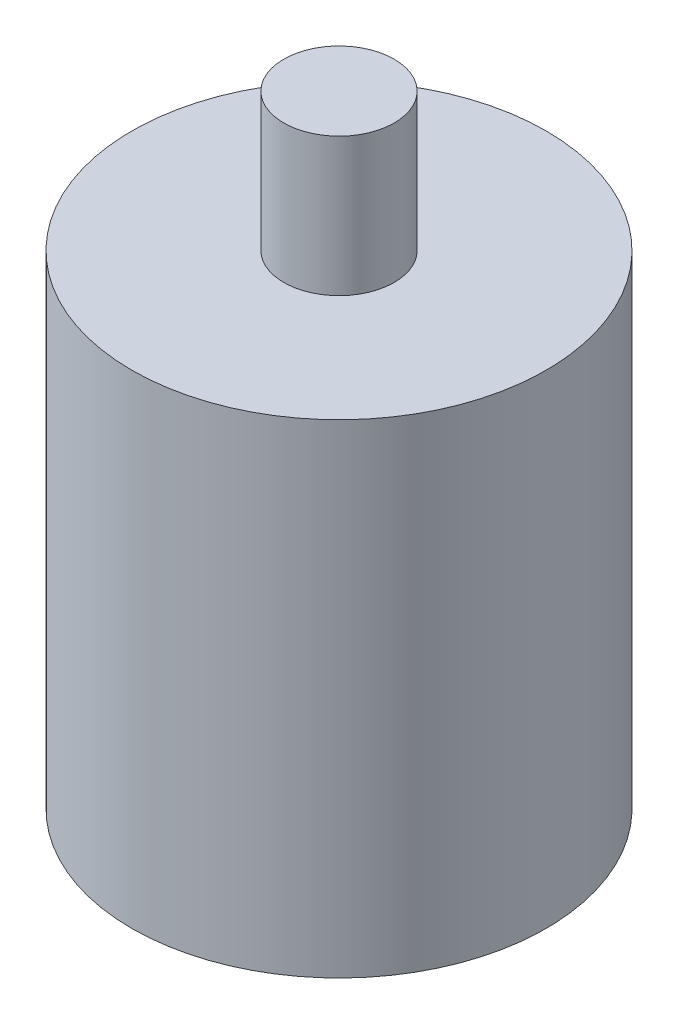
ISO-10303-21;
HEADER;
FILE_DESCRIPTION(('STEP AP214'),'2;1');
FILE_NAME('part.step','',(''),(''),'','','');
FILE_SCHEMA(('AUTOMOTIVE_DESIGN { 1 0 10303 214 1 1 1 1 }'));
ENDSEC;
DATA;
#1=APPLICATION_CONTEXT('core data for automotive mechanical design processes');
#2=APPLICATION_PROTOCOL_DEFINITION('international standard','automotive_design',2000,#1);
#3=PRODUCT_CONTEXT('',#1,'mechanical');
#4=PRODUCT('Part','Part','',(#3));
#5=PRODUCT_RELATED_PRODUCT_CATEGORY('part','',(#4));
#6=PRODUCT_DEFINITION_FORMATION('','',#4);
#7=PRODUCT_DEFINITION_CONTEXT('part definition',#1,'design');
#8=PRODUCT_DEFINITION('design','',#6,#7);
#9=PRODUCT_DEFINITION_SHAPE('','',#8);
#10=(LENGTH_UNIT() NAMED_UNIT(*) SI_UNIT(.MILLI.,.METRE.));
#11=(NAMED_UNIT(*) PLANE_ANGLE_UNIT() SI_UNIT($,.RADIAN.));
#12=(NAMED_UNIT(*) SI_UNIT($,.STERADIAN.) SOLID_ANGLE_UNIT());
#13=UNCERTAINTY_MEASURE_WITH_UNIT(LENGTH_MEASURE(1.E-05),#10,'distance_accuracy_value','');
#14=(GEOMETRIC_REPRESENTATION_CONTEXT(3) GLOBAL_UNCERTAINTY_ASSIGNED_CONTEXT((#13)) GLOBAL_UNIT_ASSIGNED_CONTEXT((#10,
#11,#12)) REPRESENTATION_CONTEXT('',''));
#15=CARTESIAN_POINT('',(0.,0.,0.));
#16=DIRECTION('',(0.,0.,1.));
#17=DIRECTION('',(1.,0.,0.));
#18=AXIS2_PLACEMENT_3D('',#15,#16,#17);
#19=CARTESIAN_POINT('',(0.,0.,0.));
#20=DIRECTION('',(0.,-1.,0.));
#21=DIRECTION('',(0.,0.,-1.));
#22=AXIS2_PLACEMENT_3D('',#19,#20,#21);
#23=CYLINDRICAL_SURFACE('',#22,3.25);
#24=CARTESIAN_POINT('',(3.25,-35.,0.));
#25=CARTESIAN_POINT('',(3.25,-34.921875,-1.34619407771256));
#26=CARTESIAN_POINT('',(2.29809703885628,-34.84375,-2.29809703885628));
#27=CARTESIAN_POINT('',(1.34619407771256,-34.765625,-3.25));
#28=CARTESIAN_POINT('',(0.,-34.6875,-3.25));
#29=CARTESIAN_POINT('',(-1.34619407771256,-34.609375,-3.25));
#30=CARTESIAN_POINT('',(-2.29809703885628,-34.53125,-2.29809703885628));
#31=CARTESIAN_POINT('',(-3.25,-34.453125,-1.34619407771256));
#32=CARTESIAN_POINT('',(-3.25,-34.375,0.));
#33=CARTESIAN_POINT('',(-3.25,-34.296875,1.34619407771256));
#34=CARTESIAN_POINT('',(-2.29809703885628,-34.21875,2.29809703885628));
#35=CARTESIAN_POINT('',(-1.34619407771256,-34.140625,3.25));
#36=CARTESIAN_POINT('',(0.,-34.0625,3.25));
#37=CARTESIAN_POINT('',(1.34619407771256,-33.984375,3.25));
#38=CARTESIAN_POINT('',(2.29809703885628,-33.90625,2.29809703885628));
#39=CARTESIAN_POINT('',(3.25,-33.828125,1.34619407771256));
#40=CARTESIAN_POINT('',(3.25,-33.75,0.));
#41=CARTESIAN_POINT('',(3.25,-33.671875,-1.34619407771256));
#42=CARTESIAN_POINT('',(2.29809703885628,-33.59375,-2.29809703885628));
#43=CARTESIAN_POINT('',(1.34619407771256,-33.515625,-3.25));
#44=CARTESIAN_POINT('',(0.,-33.4375,-3.25));
#45=CARTESIAN_POINT('',(-1.34619407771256,-33.359375,-3.25));
#46=CARTESIAN_POINT('',(-2.29809703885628,-33.28125,-2.29809703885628));
#47=CARTESIAN_POINT('',(-3.25,-33.203125,-1.34619407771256));
#48=CARTESIAN_POINT('',(-3.25,-33.125,0.));
#49=CARTESIAN_POINT('',(-3.25,-33.046875,1.34619407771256));
#50=CARTESIAN_POINT('',(-2.29809703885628,-32.96875,2.29809703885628));
#51=CARTESIAN_POINT('',(-1.34619407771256,-32.890625,3.25));
#52=CARTESIAN_POINT('',(0.,-32.8125,3.25));
#53=CARTESIAN_POINT('',(1.34619407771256,-32.734375,3.25));
#54=CARTESIAN_POINT('',(2.29809703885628,-32.65625,2.29809703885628));
#55=CARTESIAN_POINT('',(3.25,-32.578125,1.34619407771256));
#56=CARTESIAN_POINT('',(3.25,-32.5,0.));
#57=CARTESIAN_POINT('',(3.25,-32.421875,-1.34619407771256));
#58=CARTESIAN_POINT('',(2.29809703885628,-32.34375,-2.29809703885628));
#59=CARTESIAN_POINT('',(1.34619407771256,-32.265625,-3.25));
#60=CARTESIAN_POINT('',(0.,-32.1875,-3.25));
#61=CARTESIAN_POINT('',(-1.34619407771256,-32.109375,-3.25));
#62=CARTESIAN_POINT('',(-2.29809703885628,-32.03125,-2.29809703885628));
#63=CARTESIAN_POINT('',(-3.25,-31.953125,-1.34619407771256));
#64=CARTESIAN_POINT('',(-3.25,-31.875,0.));
#65=CARTESIAN_POINT('',(-3.25,-31.796875,1.34619407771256));
#66=CARTESIAN_POINT('',(-2.29809703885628,-31.71875,2.29809703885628));
#67=CARTESIAN_POINT('',(-1.34619407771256,-31.640625,3.25));
#68=CARTESIAN_POINT('',(0.,-31.5625,3.25));
#69=CARTESIAN_POINT('',(1.34619407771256,-31.484375,3.25));
#70=CARTESIAN_POINT('',(2.29809703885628,-31.40625,2.29809703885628));
#71=CARTESIAN_POINT('',(3.25,-31.328125,1.34619407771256));
#72=CARTESIAN_POINT('',(3.25,-31.25,0.));
#73=CARTESIAN_POINT('',(3.25,-31.171875,-1.34619407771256));
#74=CARTESIAN_POINT('',(2.29809703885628,-31.09375,-2.29809703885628));
#75=CARTESIAN_POINT('',(1.34619407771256,-31.015625,-3.25));
#76=CARTESIAN_POINT('',(0.,-30.9375,-3.25));
#77=CARTESIAN_POINT('',(-1.34619407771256,-30.859375,-3.25));
#78=CARTESIAN_POINT('',(-2.29809703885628,-30.78125,-2.29809703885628));
#79=CARTESIAN_POINT('',(-3.25,-30.703125,-1.34619407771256));
#80=CARTESIAN_POINT('',(-3.25,-30.625,0.));
#81=CARTESIAN_POINT('',(-3.25,-30.546875,1.34619407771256));
#82=CARTESIAN_POINT('',(-2.29809703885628,-30.46875,2.29809703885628));
#83=CARTESIAN_POINT('',(-1.34619407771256,-30.390625,3.25));
#84=CARTESIAN_POINT('',(0.,-30.3125,3.25));
#85=CARTESIAN_POINT('',(1.34619407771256,-30.234375,3.25));
#86=CARTESIAN_POINT('',(2.29809703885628,-30.15625,2.29809703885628));
#87=CARTESIAN_POINT('',(3.25,-30.078125,1.34619407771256));
#88=CARTESIAN_POINT('',(3.25,-30.,0.));
#89=CARTESIAN_POINT('',(3.25,-29.921875,-1.34619407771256));
#90=CARTESIAN_POINT('',(2.29809703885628,-29.84375,-2.29809703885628));
#91=CARTESIAN_POINT('',(1.34619407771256,-29.765625,-3.25));
#92=CARTESIAN_POINT('',(0.,-29.6875,-3.25));
#93=CARTESIAN_POINT('',(-1.34619407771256,-29.609375,-3.25));
#94=CARTESIAN_POINT('',(-2.29809703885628,-29.53125,-2.29809703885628));
#95=CARTESIAN_POINT('',(-3.25,-29.453125,-1.34619407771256));
#96=CARTESIAN_POINT('',(-3.25,-29.375,0.));
#97=CARTESIAN_POINT('',(-3.25,-29.296875,1.34619407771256));
#98=CARTESIAN_POINT('',(-2.29809703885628,-29.21875,2.29809703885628));
#99=CARTESIAN_POINT('',(-1.34619407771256,-29.140625,3.25));
#100=CARTESIAN_POINT('',(0.,-29.0625,3.25));
#101=CARTESIAN_POINT('',(1.34619407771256,-28.984375,3.25));
#102=CARTESIAN_POINT('',(2.29809703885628,-28.90625,2.29809703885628));
#103=CARTESIAN_POINT('',(3.25,-28.828125,1.34619407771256));
#104=CARTESIAN_POINT('',(3.25,-28.75,0.));
#105=CARTESIAN_POINT('',(3.25,-28.671875,-1.34619407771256));
#106=CARTESIAN_POINT('',(2.29809703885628,-28.59375,-2.29809703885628));
#107=CARTESIAN_POINT('',(1.34619407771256,-28.515625,-3.25));
#108=CARTESIAN_POINT('',(0.,-28.4375,-3.25));
#109=CARTESIAN_POINT('',(-1.34619407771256,-28.359375,-3.25));
#110=CARTESIAN_POINT('',(-2.29809703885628,-28.28125,-2.29809703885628));
#111=CARTESIAN_POINT('',(-3.25,-28.203125,-1.34619407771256));
#112=CARTESIAN_POINT('',(-3.25,-28.125,0.));
#113=CARTESIAN_POINT('',(-3.25,-28.046875,1.34619407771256));
#114=CARTESIAN_POINT('',(-2.29809703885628,-27.96875,2.29809703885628));
#115=CARTESIAN_POINT('',(-1.34619407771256,-27.890625,3.25));
#116=CARTESIAN_POINT('',(0.,-27.8125,3.25));
#117=CARTESIAN_POINT('',(1.34619407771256,-27.734375,3.25));
#118=CARTESIAN_POINT('',(2.29809703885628,-27.65625,2.29809703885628));
#119=CARTESIAN_POINT('',(3.25,-27.578125,1.34619407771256));
#120=CARTESIAN_POINT('',(3.25,-27.5,0.));
#121=CARTESIAN_POINT('',(3.25,-27.421875,-1.34619407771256));
#122=CARTESIAN_POINT('',(2.29809703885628,-27.34375,-2.29809703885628));
#123=CARTESIAN_POINT('',(1.34619407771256,-27.265625,-3.25));
#124=CARTESIAN_POINT('',(0.,-27.1875,-3.25));
#125=CARTESIAN_POINT('',(-1.34619407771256,-27.109375,-3.25));
#126=CARTESIAN_POINT('',(-2.29809703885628,-27.03125,-2.29809703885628));
#127=CARTESIAN_POINT('',(-3.25,-26.953125,-1.34619407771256));
#128=CARTESIAN_POINT('',(-3.25,-26.875,0.));
#129=CARTESIAN_POINT('',(-3.25,-26.796875,1.34619407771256));
#130=CARTESIAN_POINT('',(-2.29809703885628,-26.71875,2.29809703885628));
#131=CARTESIAN_POINT('',(-1.34619407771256,-26.640625,3.25));
#132=CARTESIAN_POINT('',(0.,-26.5625,3.25));
#133=CARTESIAN_POINT('',(1.34619407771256,-26.484375,3.25));
#134=CARTESIAN_POINT('',(2.29809703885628,-26.40625,2.29809703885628));
#135=CARTESIAN_POINT('',(3.25,-26.328125,1.34619407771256));
#136=CARTESIAN_POINT('',(3.25,-26.25,0.));
#137=CARTESIAN_POINT('',(3.25,-26.171875,-1.34619407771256));
#138=CARTESIAN_POINT('',(2.29809703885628,-26.09375,-2.29809703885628));
#139=CARTESIAN_POINT('',(1.34619407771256,-26.015625,-3.25));
#140=CARTESIAN_POINT('',(0.,-25.9375,-3.25));
#141=CARTESIAN_POINT('',(-1.34619407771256,-25.859375,-3.25));
#142=CARTESIAN_POINT('',(-2.29809703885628,-25.78125,-2.29809703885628));
#143=CARTESIAN_POINT('',(-3.25,-25.703125,-1.34619407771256));
#144=CARTESIAN_POINT('',(-3.25,-25.625,0.));
#145=CARTESIAN_POINT('',(-3.25,-25.546875,1.34619407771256));
#146=CARTESIAN_POINT('',(-2.29809703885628,-25.46875,2.29809703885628));
#147=CARTESIAN_POINT('',(-1.34619407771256,-25.390625,3.25));
#148=CARTESIAN_POINT('',(0.,-25.3125,3.25));
#149=CARTESIAN_POINT('',(1.34619407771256,-25.234375,3.25));
#150=CARTESIAN_POINT('',(2.29809703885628,-25.15625,2.29809703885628));
#151=CARTESIAN_POINT('',(3.25,-25.078125,1.34619407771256));
#152=CARTESIAN_POINT('',(3.25,-25.,0.));
#153=(BOUNDED_CURVE() B_SPLINE_CURVE(2,(#24,#25,#26,#27,#28,#29,#30,#31,#32,#33,#34,#35,#36,#37,
#38,#39,#40,#41,#42,#43,#44,#45,#46,#47,#48,#49,#50,#51,#52,#53,#54,#55,#56,#57,#58,#59,#60,#61,
#62,#63,#64,#65,#66,#67,#68,#69,#70,#71,#72,#73,#74,#75,#76,#77,#78,#79,#80,#81,#82,#83,#84,#85,
#86,#87,#88,#89,#90,#91,#92,#93,#94,#95,#96,#97,#98,#99,#100,#101,#102,#103,#104,#105,#106,#107,
#108,#109,#110,#111,#112,#113,#114,#115,#116,#117,#118,#119,#120,#121,#122,#123,#124,#125,#126,
#127,#128,#129,#130,#131,#132,#133,#134,#135,#136,#137,#138,#139,#140,#141,#142,#143,#144,#145,
#146,#147,#148,#149,#150,#151,#152),.UNSPECIFIED.,.F.,.F.) B_SPLINE_CURVE_WITH_KNOTS((3,2,2,2,2,
2,2,2,2,2,2,2,2,2,2,2,2,2,2,2,2,2,2,2,2,2,2,2,2,2,2,2,2,2,2,2,2,2,2,2,2,2,2,2,2,2,2,2,2,2,2,2,2,
2,2,2,2,2,2,2,2,2,2,2,3),(0.,0.015625,0.03125,0.046875,0.0625,0.078125,0.09375,0.109375,0.125,
0.140625,0.15625,0.171875,0.1875,0.203125,0.21875,0.234375,0.25,0.265625,0.28125,0.296875,
0.3125,0.328125,0.34375,0.359375,0.375,0.390625,0.40625,0.421875,0.4375,0.453125,0.46875,
0.484375,0.5,0.515625,0.53125,0.546875,0.5625,0.578125,0.59375,0.609375,0.625,0.640625,0.65625,
0.671875,0.6875,0.703125,0.71875,0.734375,0.75,0.765625,0.78125,0.796875,0.8125,0.828125,
0.84375,0.859375,0.875,0.890625,0.90625,0.921875,0.9375,0.953125,0.96875,0.984375,1.),
.UNSPECIFIED.) CURVE() GEOMETRIC_REPRESENTATION_ITEM() RATIONAL_B_SPLINE_CURVE((1.,
0.923879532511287,1.,0.923879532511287,1.,0.923879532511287,1.,0.923879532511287,1.,
0.923879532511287,1.,0.923879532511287,1.,0.923879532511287,1.,0.923879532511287,1.,
0.923879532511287,1.,0.923879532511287,1.,0.923879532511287,1.,0.923879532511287,1.,
0.923879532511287,1.,0.923879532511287,1.,0.923879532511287,1.,0.923879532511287,1.,
0.923879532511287,1.,0.923879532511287,1.,0.923879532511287,1.,0.923879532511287,1.,
0.923879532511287,1.,0.923879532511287,1.,0.923879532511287,1.,0.923879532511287,1.,
0.923879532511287,1.,0.923879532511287,1.,0.923879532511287,1.,0.923879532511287,1.,
0.923879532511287,1.,0.923879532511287,1.,0.923879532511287,1.,0.923879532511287,1.,
0.923879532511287,1.,0.923879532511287,1.,0.923879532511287,1.,0.923879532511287,1.,
0.923879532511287,1.,0.923879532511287,1.,0.923879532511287,1.,0.923879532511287,1.,
0.923879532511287,1.,0.923879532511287,1.,0.923879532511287,1.,0.923879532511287,1.,
0.923879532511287,1.,0.923879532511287,1.,0.923879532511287,1.,0.923879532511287,1.,
0.923879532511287,1.,0.923879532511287,1.,0.923879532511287,1.,0.923879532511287,1.,
0.923879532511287,1.,0.923879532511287,1.,0.923879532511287,1.,0.923879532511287,1.,
0.923879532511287,1.,0.923879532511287,1.,0.923879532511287,1.,0.923879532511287,1.,
0.923879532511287,1.,0.923879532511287,1.,0.923879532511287,1.,0.923879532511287,1.)) REPRESENTATION_ITEM(''));
#154=CARTESIAN_POINT('',(3.25,-35.,0.));
#155=VERTEX_POINT('',#154);
#156=CARTESIAN_POINT('',(3.25,-25.,0.));
#157=VERTEX_POINT('',#156);
#158=EDGE_CURVE('E93',#155,#157,#153,.T.);
#159=ORIENTED_EDGE('',*,*,#158,.T.);
#160=CARTESIAN_POINT('',(0.,-25.,0.));
#161=DIRECTION('',(0.,-1.,0.));
#162=DIRECTION('',(0.,0.,-1.));
#163=AXIS2_PLACEMENT_3D('',#160,#161,#162);
#164=CIRCLE('',#163,3.25);
#165=CARTESIAN_POINT('',(0.,-25.,-3.25));
#166=VERTEX_POINT('',#165);
#167=EDGE_CURVE('E42',#166,#157,#164,.T.);
#168=ORIENTED_EDGE('',*,*,#167,.F.);
#169=CARTESIAN_POINT('',(3.25,-34.062500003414,0.));
#170=CARTESIAN_POINT('',(3.25,-33.984375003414,-1.34619407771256));
#171=CARTESIAN_POINT('',(2.29809703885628,-33.906250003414,-2.29809703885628));
#172=CARTESIAN_POINT('',(1.34619407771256,-33.828125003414,-3.25));
#173=CARTESIAN_POINT('',(0.,-33.750000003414,-3.25));
#174=CARTESIAN_POINT('',(-1.34619407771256,-33.671875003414,-3.25));
#175=CARTESIAN_POINT('',(-2.29809703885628,-33.593750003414,-2.29809703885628));
#176=CARTESIAN_POINT('',(-3.25,-33.515625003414,-1.34619407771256));
#177=CARTESIAN_POINT('',(-3.25,-33.437500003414,0.));
#178=CARTESIAN_POINT('',(-3.25,-33.359375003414,1.34619407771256));
#179=CARTESIAN_POINT('',(-2.29809703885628,-33.281250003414,2.29809703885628));
#180=CARTESIAN_POINT('',(-1.34619407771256,-33.203125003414,3.25));
#181=CARTESIAN_POINT('',(0.,-33.125000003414,3.25));
#182=CARTESIAN_POINT('',(1.34619407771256,-33.046875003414,3.25));
#183=CARTESIAN_POINT('',(2.29809703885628,-32.968750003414,2.29809703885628));
#184=CARTESIAN_POINT('',(3.25,-32.890625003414,1.34619407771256));
#185=CARTESIAN_POINT('',(3.25,-32.812500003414,0.));
#186=CARTESIAN_POINT('',(3.25,-32.734375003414,-1.34619407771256));
#187=CARTESIAN_POINT('',(2.29809703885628,-32.656250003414,-2.29809703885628));
#188=CARTESIAN_POINT('',(1.34619407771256,-32.578125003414,-3.25));
#189=CARTESIAN_POINT('',(0.,-32.500000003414,-3.25));
#190=CARTESIAN_POINT('',(-1.34619407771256,-32.421875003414,-3.25));
#191=CARTESIAN_POINT('',(-2.29809703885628,-32.343750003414,-2.29809703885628));
#192=CARTESIAN_POINT('',(-3.25,-32.265625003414,-1.34619407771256));
#193=CARTESIAN_POINT('',(-3.25,-32.187500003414,0.));
#194=CARTESIAN_POINT('',(-3.25,-32.109375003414,1.34619407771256));
#195=CARTESIAN_POINT('',(-2.29809703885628,-32.031250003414,2.29809703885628));
#196=CARTESIAN_POINT('',(-1.34619407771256,-31.953125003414,3.25));
#197=CARTESIAN_POINT('',(0.,-31.875000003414,3.25));
#198=CARTESIAN_POINT('',(1.34619407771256,-31.796875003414,3.25));
#199=CARTESIAN_POINT('',(2.29809703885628,-31.718750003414,2.29809703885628));
#200=CARTESIAN_POINT('',(3.25,-31.640625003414,1.34619407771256));
#201=CARTESIAN_POINT('',(3.25,-31.562500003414,0.));
#202=CARTESIAN_POINT('',(3.25,-31.484375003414,-1.34619407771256));
#203=CARTESIAN_POINT('',(2.29809703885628,-31.406250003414,-2.29809703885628));
#204=CARTESIAN_POINT('',(1.34619407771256,-31.328125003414,-3.25));
#205=CARTESIAN_POINT('',(0.,-31.250000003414,-3.25));
#206=CARTESIAN_POINT('',(-1.34619407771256,-31.171875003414,-3.25));
#207=CARTESIAN_POINT('',(-2.29809703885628,-31.093750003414,-2.29809703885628));
#208=CARTESIAN_POINT('',(-3.25,-31.015625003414,-1.34619407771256));
#209=CARTESIAN_POINT('',(-3.25,-30.937500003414,0.));
#210=CARTESIAN_POINT('',(-3.25,-30.859375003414,1.34619407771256));
#211=CARTESIAN_POINT('',(-2.29809703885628,-30.781250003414,2.29809703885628));
#212=CARTESIAN_POINT('',(-1.34619407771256,-30.703125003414,3.25));
#213=CARTESIAN_POINT('',(0.,-30.625000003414,3.25));
#214=CARTESIAN_POINT('',(1.34619407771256,-30.546875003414,3.25));
#215=CARTESIAN_POINT('',(2.29809703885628,-30.468750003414,2.29809703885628));
#216=CARTESIAN_POINT('',(3.25,-30.390625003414,1.34619407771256));
#217=CARTESIAN_POINT('',(3.25,-30.312500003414,0.));
#218=CARTESIAN_POINT('',(3.25,-30.234375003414,-1.34619407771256));
#219=CARTESIAN_POINT('',(2.29809703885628,-30.156250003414,-2.29809703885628));
#220=CARTESIAN_POINT('',(1.34619407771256,-30.078125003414,-3.25));
#221=CARTESIAN_POINT('',(0.,-30.000000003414,-3.25));
#222=CARTESIAN_POINT('',(-1.34619407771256,-29.921875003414,-3.25));
#223=CARTESIAN_POINT('',(-2.29809703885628,-29.843750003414,-2.29809703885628));
#224=CARTESIAN_POINT('',(-3.25,-29.765625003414,-1.34619407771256));
#225=CARTESIAN_POINT('',(-3.25,-29.687500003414,0.));
#226=CARTESIAN_POINT('',(-3.25,-29.609375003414,1.34619407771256));
#227=CARTESIAN_POINT('',(-2.29809703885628,-29.531250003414,2.29809703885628));
#228=CARTESIAN_POINT('',(-1.34619407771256,-29.453125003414,3.25));
#229=CARTESIAN_POINT('',(0.,-29.375000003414,3.25));
#230=CARTESIAN_POINT('',(1.34619407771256,-29.296875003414,3.25));
#231=CARTESIAN_POINT('',(2.29809703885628,-29.218750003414,2.29809703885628));
#232=CARTESIAN_POINT('',(3.25,-29.140625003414,1.34619407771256));
#233=CARTESIAN_POINT('',(3.25,-29.062500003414,0.));
#234=CARTESIAN_POINT('',(3.25,-28.984375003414,-1.34619407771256));
#235=CARTESIAN_POINT('',(2.29809703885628,-28.906250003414,-2.29809703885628));
#236=CARTESIAN_POINT('',(1.34619407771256,-28.828125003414,-3.25));
#237=CARTESIAN_POINT('',(0.,-28.750000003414,-3.25));
#238=CARTESIAN_POINT('',(-1.34619407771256,-28.671875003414,-3.25));
#239=CARTESIAN_POINT('',(-2.29809703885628,-28.593750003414,-2.29809703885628));
#240=CARTESIAN_POINT('',(-3.25,-28.515625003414,-1.34619407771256));
#241=CARTESIAN_POINT('',(-3.25,-28.437500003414,0.));
#242=CARTESIAN_POINT('',(-3.25,-28.359375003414,1.34619407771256));
#243=CARTESIAN_POINT('',(-2.29809703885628,-28.281250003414,2.29809703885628));
#244=CARTESIAN_POINT('',(-1.34619407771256,-28.203125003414,3.25));
#245=CARTESIAN_POINT('',(0.,-28.125000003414,3.25));
#246=CARTESIAN_POINT('',(1.34619407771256,-28.046875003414,3.25));
#247=CARTESIAN_POINT('',(2.29809703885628,-27.968750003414,2.29809703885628));
#248=CARTESIAN_POINT('',(3.25,-27.890625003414,1.34619407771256));
#249=CARTESIAN_POINT('',(3.25,-27.812500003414,0.));
#250=CARTESIAN_POINT('',(3.25,-27.734375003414,-1.34619407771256));
#251=CARTESIAN_POINT('',(2.29809703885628,-27.656250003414,-2.29809703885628));
#252=CARTESIAN_POINT('',(1.34619407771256,-27.578125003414,-3.25));
#253=CARTESIAN_POINT('',(0.,-27.500000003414,-3.25));
#254=CARTESIAN_POINT('',(-1.34619407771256,-27.421875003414,-3.25));
#255=CARTESIAN_POINT('',(-2.29809703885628,-27.343750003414,-2.29809703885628));
#256=CARTESIAN_POINT('',(-3.25,-27.265625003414,-1.34619407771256));
#257=CARTESIAN_POINT('',(-3.25,-27.187500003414,0.));
#258=CARTESIAN_POINT('',(-3.25,-27.109375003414,1.34619407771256));
#259=CARTESIAN_POINT('',(-2.29809703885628,-27.031250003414,2.29809703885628));
#260=CARTESIAN_POINT('',(-1.34619407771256,-26.953125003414,3.25));
#261=CARTESIAN_POINT('',(0.,-26.875000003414,3.25));
#262=CARTESIAN_POINT('',(1.34619407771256,-26.796875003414,3.25));
#263=CARTESIAN_POINT('',(2.29809703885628,-26.718750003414,2.29809703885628));
#264=CARTESIAN_POINT('',(3.25,-26.640625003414,1.34619407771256));
#265=CARTESIAN_POINT('',(3.25,-26.562500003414,0.));
#266=CARTESIAN_POINT('',(3.25,-26.484375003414,-1.34619407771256));
#267=CARTESIAN_POINT('',(2.29809703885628,-26.406250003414,-2.29809703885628));
#268=CARTESIAN_POINT('',(1.34619407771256,-26.328125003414,-3.25));
#269=CARTESIAN_POINT('',(0.,-26.250000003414,-3.25));
#270=CARTESIAN_POINT('',(-1.34619407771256,-26.171875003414,-3.25));
#271=CARTESIAN_POINT('',(-2.29809703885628,-26.093750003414,-2.29809703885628));
#272=CARTESIAN_POINT('',(-3.25,-26.015625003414,-1.34619407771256));
#273=CARTESIAN_POINT('',(-3.25,-25.937500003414,0.));
#274=CARTESIAN_POINT('',(-3.25,-25.859375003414,1.34619407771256));
#275=CARTESIAN_POINT('',(-2.29809703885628,-25.781250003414,2.29809703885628));
#276=CARTESIAN_POINT('',(-1.34619407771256,-25.703125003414,3.25));
#277=CARTESIAN_POINT('',(0.,-25.625000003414,3.25));
#278=CARTESIAN_POINT('',(1.34619407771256,-25.546875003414,3.25));
#279=CARTESIAN_POINT('',(2.29809703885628,-25.468750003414,2.29809703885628));
#280=CARTESIAN_POINT('',(3.25,-25.390625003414,1.34619407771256));
#281=CARTESIAN_POINT('',(3.25,-25.312500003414,0.));
#282=CARTESIAN_POINT('',(3.25,-25.234375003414,-1.34619407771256));
#283=CARTESIAN_POINT('',(2.29809703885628,-25.156250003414,-2.29809703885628));
#284=CARTESIAN_POINT('',(1.34619407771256,-25.078125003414,-3.25));
#285=CARTESIAN_POINT('',(0.,-25.000000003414,-3.25));
#286=CARTESIAN_POINT('',(-1.34619407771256,-24.921875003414,-3.25));
#287=CARTESIAN_POINT('',(-2.29809703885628,-24.843750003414,-2.29809703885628));
#288=CARTESIAN_POINT('',(-3.25,-24.765625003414,-1.34619407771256));
#289=CARTESIAN_POINT('',(-3.25,-24.687500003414,0.));
#290=CARTESIAN_POINT('',(-3.25,-24.609375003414,1.34619407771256));
#291=CARTESIAN_POINT('',(-2.29809703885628,-24.531250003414,2.29809703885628));
#292=CARTESIAN_POINT('',(-1.34619407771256,-24.453125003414,3.25));
#293=CARTESIAN_POINT('',(0.,-24.375000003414,3.25));
#294=CARTESIAN_POINT('',(1.34619407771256,-24.296875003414,3.25));
#295=CARTESIAN_POINT('',(2.29809703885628,-24.218750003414,2.29809703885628));
#296=CARTESIAN_POINT('',(3.25,-24.140625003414,1.34619407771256));
#297=CARTESIAN_POINT('',(3.25,-24.062500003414,0.));
#298=(BOUNDED_CURVE() B_SPLINE_CURVE(2,(#169,#170,#171,#172,#173,#174,#175,#176,#177,#178,#179,
#180,#181,#182,#183,#184,#185,#186,#187,#188,#189,#190,#191,#192,#193,#194,#195,#196,#197,#198,
#199,#200,#201,#202,#203,#204,#205,#206,#207,#208,#209,#210,#211,#212,#213,#214,#215,#216,#217,
#218,#219,#220,#221,#222,#223,#224,#225,#226,#227,#228,#229,#230,#231,#232,#233,#234,#235,#236,
#237,#238,#239,#240,#241,#242,#243,#244,#245,#246,#247,#248,#249,#250,#251,#252,#253,#254,#255,
#256,#257,#258,#259,#260,#261,#262,#263,#264,#265,#266,#267,#268,#269,#270,#271,#272,#273,#274,
#275,#276,#277,#278,#279,#280,#281,#282,#283,#284,#285,#286,#287,#288,#289,#290,#291,#292,#293,
#294,#295,#296,#297),.UNSPECIFIED.,.F.,.F.) B_SPLINE_CURVE_WITH_KNOTS((3,2,2,2,2,2,2,2,2,2,2,2,
2,2,2,2,2,2,2,2,2,2,2,2,2,2,2,2,2,2,2,2,2,2,2,2,2,2,2,2,2,2,2,2,2,2,2,2,2,2,2,2,2,2,2,2,2,2,2,2,
2,2,2,2,3),(0.,0.015625,0.03125,0.046875,0.0625,0.078125,0.09375,0.109375,0.125,0.140625,
0.15625,0.171875,0.1875,0.203125,0.21875,0.234375,0.25,0.265625,0.28125,0.296875,0.3125,
0.328125,0.34375,0.359375,0.375,0.390625,0.40625,0.421875,0.4375,0.453125,0.46875,0.484375,0.5,
0.515625,0.53125,0.546875,0.5625,0.578125,0.59375,0.609375,0.625,0.640625,0.65625,0.671875,
0.6875,0.703125,0.71875,0.734375,0.75,0.765625,0.78125,0.796875,0.8125,0.828125,0.84375,
0.859375,0.875,0.890625,0.90625,0.921875,0.9375,0.953125,0.96875,0.984375,1.),
.UNSPECIFIED.) CURVE() GEOMETRIC_REPRESENTATION_ITEM() RATIONAL_B_SPLINE_CURVE((1.,
0.923879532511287,1.,0.923879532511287,1.,0.923879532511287,1.,0.923879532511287,1.,
0.923879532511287,1.,0.923879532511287,1.,0.923879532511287,1.,0.923879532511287,1.,
0.923879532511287,1.,0.923879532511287,1.,0.923879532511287,1.,0.923879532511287,1.,
0.923879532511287,1.,0.923879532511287,1.,0.923879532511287,1.,0.923879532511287,1.,
0.923879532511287,1.,0.923879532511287,1.,0.923879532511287,1.,0.923879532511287,1.,
0.923879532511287,1.,0.923879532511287,1.,0.923879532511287,1.,0.923879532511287,1.,
0.923879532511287,1.,0.923879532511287,1.,0.923879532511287,1.,0.923879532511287,1.,
0.923879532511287,1.,0.923879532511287,1.,0.923879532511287,1.,0.923879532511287,1.,
0.923879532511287,1.,0.923879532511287,1.,0.923879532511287,1.,0.923879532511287,1.,
0.923879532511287,1.,0.923879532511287,1.,0.923879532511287,1.,0.923879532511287,1.,
0.923879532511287,1.,0.923879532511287,1.,0.923879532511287,1.,0.923879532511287,1.,
0.923879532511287,1.,0.923879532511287,1.,0.923879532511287,1.,0.923879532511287,1.,
0.923879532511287,1.,0.923879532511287,1.,0.923879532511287,1.,0.923879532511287,1.,
0.923879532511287,1.,0.923879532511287,1.,0.923879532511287,1.,0.923879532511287,1.,
0.923879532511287,1.,0.923879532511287,1.,0.923879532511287,1.,0.923879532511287,1.,
0.923879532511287,1.,0.923879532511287,1.,0.923879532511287,1.,0.923879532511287,1.)) REPRESENTATION_ITEM(''));
#299=CARTESIAN_POINT('',(3.25,-34.062500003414,0.));
#300=VERTEX_POINT('',#299);
#301=EDGE_CURVE('E49',#300,#166,#298,.T.);
#302=ORIENTED_EDGE('',*,*,#301,.F.);
#303=DIRECTION('',(0.,-1.,0.));
#304=VECTOR('',#303,1.);
#305=CARTESIAN_POINT('',(3.25,-34.531250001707,0.));
#306=LINE('',#305,#304);
#307=EDGE_CURVE('E89',#300,#155,#306,.T.);
#308=ORIENTED_EDGE('',*,*,#307,.T.);
#309=CARTESIAN_POINT('',(0.,-35.,0.));
#310=DIRECTION('',(0.,-1.,0.));
#311=DIRECTION('',(0.,0.,-1.));
#312=AXIS2_PLACEMENT_3D('',#309,#310,#311);
#313=CIRCLE('',#312,3.25);
#314=EDGE_CURVE('E11',#155,#155,#313,.T.);
#315=ORIENTED_EDGE('',*,*,#314,.T.);
#316=EDGE_LOOP('',(#159,#168,#302,#308,#315));
#317=FACE_BOUND('',#316,.T.);
#318=ADVANCED_FACE('F34',(#317),#23,.F.);
#319=CARTESIAN_POINT('',(-15.,-35.,0.));
#320=DIRECTION('',(0.,1.,0.));
#321=DIRECTION('',(0.,0.,1.));
#322=AXIS2_PLACEMENT_3D('',#319,#320,#321);
#323=PLANE('',#322);
#324=ORIENTED_EDGE('',*,*,#314,.F.);
#325=EDGE_LOOP('',(#324));
#326=FACE_BOUND('',#325,.T.);
#327=CARTESIAN_POINT('',(0.,-35.,0.));
#328=DIRECTION('',(0.,-1.,0.));
#329=DIRECTION('',(0.,0.,-1.));
#330=AXIS2_PLACEMENT_3D('',#327,#328,#329);
#331=CIRCLE('',#330,15.);
#332=CARTESIAN_POINT('',(0.,-35.,-15.));
#333=VERTEX_POINT('',#332);
#334=EDGE_CURVE('E133',#333,#333,#331,.T.);
#335=ORIENTED_EDGE('',*,*,#334,.T.);
#336=EDGE_LOOP('',(#335));
#337=FACE_BOUND('',#336,.T.);
#338=ADVANCED_FACE('F36',(#326,#337),#323,.F.);
#339=CARTESIAN_POINT('',(-3.25,-25.,0.));
#340=DIRECTION('',(0.,1.,0.));
#341=DIRECTION('',(0.,0.,1.));
#342=AXIS2_PLACEMENT_3D('',#339,#340,#341);
#343=PLANE('',#342);
#344=ORIENTED_EDGE('',*,*,#167,.T.);
#345=EDGE_CURVE('E151',#157,#166,#164,.T.);
#346=ORIENTED_EDGE('',*,*,#345,.T.);
#347=EDGE_LOOP('',(#344,#346));
#348=FACE_BOUND('',#347,.T.);
#349=ADVANCED_FACE('F154',(#348),#343,.F.);
#350=CARTESIAN_POINT('',(0.,10.,0.));
#351=DIRECTION('',(0.,-1.,0.));
#352=DIRECTION('',(0.,0.,-1.));
#353=AXIS2_PLACEMENT_3D('',#350,#351,#352);
#354=PLANE('',#353);
#355=CARTESIAN_POINT('',(0.,10.,0.));
#356=DIRECTION('',(0.,-1.,0.));
#357=DIRECTION('',(0.,0.,-1.));
#358=AXIS2_PLACEMENT_3D('',#355,#356,#357);
#359=CIRCLE('',#358,4.);
#360=CARTESIAN_POINT('',(0.,10.,-4.));
#361=VERTEX_POINT('',#360);
#362=EDGE_CURVE('E149',#361,#361,#359,.T.);
#363=ORIENTED_EDGE('',*,*,#362,.F.);
#364=EDGE_LOOP('',(#363));
#365=FACE_BOUND('',#364,.T.);
#366=ADVANCED_FACE('F184',(#365),#354,.F.);
#367=CARTESIAN_POINT('',(0.,0.,0.));
#368=DIRECTION('',(0.,-1.,0.));
#369=DIRECTION('',(0.,0.,-1.));
#370=AXIS2_PLACEMENT_3D('',#367,#368,#369);
#371=CYLINDRICAL_SURFACE('',#370,4.);
#372=CARTESIAN_POINT('',(0.,0.,0.));
#373=DIRECTION('',(0.,-1.,0.));
#374=DIRECTION('',(0.,0.,-1.));
#375=AXIS2_PLACEMENT_3D('',#372,#373,#374);
#376=CIRCLE('',#375,3.99999999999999);
#377=CARTESIAN_POINT('',(0.,0.,-3.99999999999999));
#378=VERTEX_POINT('',#377);
#379=EDGE_CURVE('E146',#378,#378,#376,.T.);
#380=ORIENTED_EDGE('',*,*,#379,.F.);
#381=EDGE_LOOP('',(#380));
#382=FACE_BOUND('',#381,.T.);
#383=ORIENTED_EDGE('',*,*,#362,.T.);
#384=EDGE_LOOP('',(#383));
#385=FACE_BOUND('',#384,.T.);
#386=ADVANCED_FACE('F178',(#382,#385),#371,.T.);
#387=CARTESIAN_POINT('',(-3.99999999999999,0.,0.));
#388=DIRECTION('',(0.,-1.,0.));
#389=DIRECTION('',(0.,0.,-1.));
#390=AXIS2_PLACEMENT_3D('',#387,#388,#389);
#391=PLANE('',#390);
#392=CARTESIAN_POINT('',(0.,0.,0.));
#393=DIRECTION('',(0.,-1.,0.));
#394=DIRECTION('',(0.,0.,-1.));
#395=AXIS2_PLACEMENT_3D('',#392,#393,#394);
#396=CIRCLE('',#395,15.);
#397=CARTESIAN_POINT('',(0.,0.,-15.));
#398=VERTEX_POINT('',#397);
#399=EDGE_CURVE('E143',#398,#398,#396,.T.);
#400=ORIENTED_EDGE('',*,*,#399,.F.);
#401=EDGE_LOOP('',(#400));
#402=FACE_BOUND('',#401,.T.);
#403=ORIENTED_EDGE('',*,*,#379,.T.);
#404=EDGE_LOOP('',(#403));
#405=FACE_BOUND('',#404,.T.);
#406=ADVANCED_FACE('F172',(#402,#405),#391,.F.);
#407=CARTESIAN_POINT('',(0.,0.,0.));
#408=DIRECTION('',(0.,-1.,0.));
#409=DIRECTION('',(0.,0.,-1.));
#410=AXIS2_PLACEMENT_3D('',#407,#408,#409);
#411=CYLINDRICAL_SURFACE('',#410,15.);
#412=ORIENTED_EDGE('',*,*,#334,.F.);
#413=EDGE_LOOP('',(#412));
#414=FACE_BOUND('',#413,.T.);
#415=ORIENTED_EDGE('',*,*,#399,.T.);
#416=EDGE_LOOP('',(#415));
#417=FACE_BOUND('',#416,.T.);
#418=ADVANCED_FACE('F169',(#414,#417),#411,.T.);
#419=CARTESIAN_POINT('',(0.,0.,0.));
#420=DIRECTION('',(0.,-1.,0.));
#421=DIRECTION('',(0.,0.,-1.));
#422=AXIS2_PLACEMENT_3D('',#419,#420,#421);
#423=CYLINDRICAL_SURFACE('',#422,3.25);
#424=ORIENTED_EDGE('',*,*,#345,.F.);
#425=DIRECTION('',(0.,1.,0.));
#426=VECTOR('',#425,1.);
#427=CARTESIAN_POINT('',(3.25,-24.531250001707,0.));
#428=LINE('',#427,#426);
#429=CARTESIAN_POINT('',(3.25,-24.062500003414,0.));
#430=VERTEX_POINT('',#429);
#431=EDGE_CURVE('E117',#157,#430,#428,.T.);
#432=ORIENTED_EDGE('',*,*,#431,.T.);
#433=EDGE_CURVE('E98',#166,#430,#298,.T.);
#434=ORIENTED_EDGE('',*,*,#433,.F.);
#435=EDGE_LOOP('',(#424,#432,#434));
#436=FACE_BOUND('',#435,.T.);
#437=ADVANCED_FACE('F157',(#436),#423,.T.);
#438=CARTESIAN_POINT('',(3.92658234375,-34.531250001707,0.));
#439=DIRECTION('',(0.,0.,1.));
#440=DIRECTION('',(1.,0.,0.));
#441=AXIS2_PLACEMENT_3D('',#438,#439,#440);
#442=PLANE('',#441);
#443=DIRECTION('',(0.,1.,0.));
#444=VECTOR('',#443,1.);
#445=CARTESIAN_POINT('',(3.92658234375,-34.531250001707,0.));
#446=LINE('',#445,#444);
#447=CARTESIAN_POINT('',(3.92658234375,-34.609375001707,0.));
#448=VERTEX_POINT('',#447);
#449=CARTESIAN_POINT('',(3.92658234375,-34.453125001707,0.));
#450=VERTEX_POINT('',#449);
#451=EDGE_CURVE('E134',#448,#450,#446,.T.);
#452=ORIENTED_EDGE('',*,*,#451,.F.);
#453=DIRECTION('',(0.866025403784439,0.499999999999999,0.));
#454=VECTOR('',#453,1.);
#455=CARTESIAN_POINT('',(3.588291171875,-34.8046875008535,0.));
#456=LINE('',#455,#454);
#457=EDGE_CURVE('E91',#155,#448,#456,.T.);
#458=ORIENTED_EDGE('',*,*,#457,.F.);
#459=ORIENTED_EDGE('',*,*,#307,.F.);
#460=DIRECTION('',(-0.866025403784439,0.499999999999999,0.));
#461=VECTOR('',#460,1.);
#462=CARTESIAN_POINT('',(3.588291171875,-34.2578125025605,0.));
#463=LINE('',#462,#461);
#464=EDGE_CURVE('E77',#450,#300,#463,.T.);
#465=ORIENTED_EDGE('',*,*,#464,.F.);
#466=EDGE_LOOP('',(#452,#458,#459,#465));
#467=FACE_BOUND('',#466,.T.);
#468=ADVANCED_FACE('F90',(#467),#442,.F.);
#469=CARTESIAN_POINT('',(3.92658234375,-24.531250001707,0.));
#470=DIRECTION('',(0.,0.,-1.));
#471=DIRECTION('',(-1.,0.,0.));
#472=AXIS2_PLACEMENT_3D('',#469,#470,#471);
#473=PLANE('',#472);
#474=DIRECTION('',(0.,-1.,0.));
#475=VECTOR('',#474,1.);
#476=CARTESIAN_POINT('',(3.92658234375,-24.531250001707,0.));
#477=LINE('',#476,#475);
#478=CARTESIAN_POINT('',(3.92658234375,-24.453125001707,0.));
#479=VERTEX_POINT('',#478);
#480=CARTESIAN_POINT('',(3.92658234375,-24.609375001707,0.));
#481=VERTEX_POINT('',#480);
#482=EDGE_CURVE('E126',#479,#481,#477,.T.);
#483=ORIENTED_EDGE('',*,*,#482,.F.);
#484=DIRECTION('',(0.866025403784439,-0.499999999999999,0.));
#485=VECTOR('',#484,1.);
#486=CARTESIAN_POINT('',(3.588291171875,-24.2578125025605,0.));
#487=LINE('',#486,#485);
#488=EDGE_CURVE('E85',#430,#479,#487,.T.);
#489=ORIENTED_EDGE('',*,*,#488,.F.);
#490=ORIENTED_EDGE('',*,*,#431,.F.);
#491=DIRECTION('',(-0.866025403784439,-0.499999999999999,0.));
#492=VECTOR('',#491,1.);
#493=CARTESIAN_POINT('',(3.588291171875,-24.8046875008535,0.));
#494=LINE('',#493,#492);
#495=EDGE_CURVE('E125',#481,#157,#494,.T.);
#496=ORIENTED_EDGE('',*,*,#495,.F.);
#497=EDGE_LOOP('',(#483,#489,#490,#496));
#498=FACE_BOUND('',#497,.T.);
#499=ADVANCED_FACE('F161',(#498),#473,.F.);
#500=CARTESIAN_POINT('',(3.92658234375,-34.609375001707,0.));
#501=CARTESIAN_POINT('',(3.92658234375,-34.531250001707,-1.62644366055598));
#502=CARTESIAN_POINT('',(2.77651300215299,-34.453125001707,-2.77651300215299));
#503=CARTESIAN_POINT('',(1.62644366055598,-34.375000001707,-3.92658234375));
#504=CARTESIAN_POINT('',(0.,-34.296875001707,-3.92658234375));
#505=CARTESIAN_POINT('',(-1.62644366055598,-34.218750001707,-3.92658234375));
#506=CARTESIAN_POINT('',(-2.77651300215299,-34.140625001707,-2.77651300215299));
#507=CARTESIAN_POINT('',(-3.92658234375,-34.062500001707,-1.62644366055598));
#508=CARTESIAN_POINT('',(-3.92658234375,-33.984375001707,0.));
#509=CARTESIAN_POINT('',(-3.92658234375,-33.906250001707,1.62644366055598));
#510=CARTESIAN_POINT('',(-2.77651300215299,-33.828125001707,2.77651300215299));
#511=CARTESIAN_POINT('',(-1.62644366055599,-33.750000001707,3.92658234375));
#512=CARTESIAN_POINT('',(0.,-33.671875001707,3.92658234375));
#513=CARTESIAN_POINT('',(1.62644366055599,-33.593750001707,3.92658234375));
#514=CARTESIAN_POINT('',(2.77651300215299,-33.515625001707,2.77651300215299));
#515=CARTESIAN_POINT('',(3.92658234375,-33.437500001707,1.62644366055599));
#516=CARTESIAN_POINT('',(3.92658234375,-33.359375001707,0.));
#517=CARTESIAN_POINT('',(3.92658234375,-33.281250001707,-1.62644366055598));
#518=CARTESIAN_POINT('',(2.77651300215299,-33.203125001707,-2.77651300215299));
#519=CARTESIAN_POINT('',(1.62644366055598,-33.125000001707,-3.92658234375));
#520=CARTESIAN_POINT('',(0.,-33.046875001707,-3.92658234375));
#521=CARTESIAN_POINT('',(-1.62644366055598,-32.968750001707,-3.92658234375));
#522=CARTESIAN_POINT('',(-2.77651300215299,-32.890625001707,-2.77651300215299));
#523=CARTESIAN_POINT('',(-3.92658234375,-32.812500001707,-1.62644366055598));
#524=CARTESIAN_POINT('',(-3.92658234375,-32.734375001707,0.));
#525=CARTESIAN_POINT('',(-3.92658234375,-32.656250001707,1.62644366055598));
#526=CARTESIAN_POINT('',(-2.77651300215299,-32.578125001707,2.77651300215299));
#527=CARTESIAN_POINT('',(-1.62644366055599,-32.500000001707,3.92658234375));
#528=CARTESIAN_POINT('',(0.,-32.421875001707,3.92658234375));
#529=CARTESIAN_POINT('',(1.62644366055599,-32.343750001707,3.92658234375));
#530=CARTESIAN_POINT('',(2.77651300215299,-32.265625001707,2.77651300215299));
#531=CARTESIAN_POINT('',(3.92658234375,-32.187500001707,1.62644366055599));
#532=CARTESIAN_POINT('',(3.92658234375,-32.109375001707,0.));
#533=CARTESIAN_POINT('',(3.92658234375,-32.031250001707,-1.62644366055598));
#534=CARTESIAN_POINT('',(2.77651300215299,-31.953125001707,-2.77651300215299));
#535=CARTESIAN_POINT('',(1.62644366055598,-31.875000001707,-3.92658234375));
#536=CARTESIAN_POINT('',(0.,-31.796875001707,-3.92658234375));
#537=CARTESIAN_POINT('',(-1.62644366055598,-31.718750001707,-3.92658234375));
#538=CARTESIAN_POINT('',(-2.77651300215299,-31.640625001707,-2.77651300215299));
#539=CARTESIAN_POINT('',(-3.92658234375,-31.562500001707,-1.62644366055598));
#540=CARTESIAN_POINT('',(-3.92658234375,-31.484375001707,0.));
#541=CARTESIAN_POINT('',(-3.92658234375,-31.406250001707,1.62644366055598));
#542=CARTESIAN_POINT('',(-2.77651300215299,-31.328125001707,2.77651300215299));
#543=CARTESIAN_POINT('',(-1.62644366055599,-31.250000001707,3.92658234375));
#544=CARTESIAN_POINT('',(0.,-31.171875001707,3.92658234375));
#545=CARTESIAN_POINT('',(1.62644366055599,-31.093750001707,3.92658234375));
#546=CARTESIAN_POINT('',(2.77651300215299,-31.015625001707,2.77651300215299));
#547=CARTESIAN_POINT('',(3.92658234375,-30.937500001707,1.62644366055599));
#548=CARTESIAN_POINT('',(3.92658234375,-30.859375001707,0.));
#549=CARTESIAN_POINT('',(3.92658234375,-30.781250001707,-1.62644366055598));
#550=CARTESIAN_POINT('',(2.77651300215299,-30.703125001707,-2.77651300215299));
#551=CARTESIAN_POINT('',(1.62644366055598,-30.625000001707,-3.92658234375));
#552=CARTESIAN_POINT('',(0.,-30.546875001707,-3.92658234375));
#553=CARTESIAN_POINT('',(-1.62644366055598,-30.468750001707,-3.92658234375));
#554=CARTESIAN_POINT('',(-2.77651300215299,-30.390625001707,-2.77651300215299));
#555=CARTESIAN_POINT('',(-3.92658234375,-30.312500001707,-1.62644366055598));
#556=CARTESIAN_POINT('',(-3.92658234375,-30.234375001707,0.));
#557=CARTESIAN_POINT('',(-3.92658234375,-30.156250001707,1.62644366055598));
#558=CARTESIAN_POINT('',(-2.77651300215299,-30.078125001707,2.77651300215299));
#559=CARTESIAN_POINT('',(-1.62644366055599,-30.000000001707,3.92658234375));
#560=CARTESIAN_POINT('',(0.,-29.921875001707,3.92658234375));
#561=CARTESIAN_POINT('',(1.62644366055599,-29.843750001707,3.92658234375));
#562=CARTESIAN_POINT('',(2.77651300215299,-29.765625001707,2.77651300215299));
#563=CARTESIAN_POINT('',(3.92658234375,-29.687500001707,1.62644366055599));
#564=CARTESIAN_POINT('',(3.92658234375,-29.609375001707,0.));
#565=CARTESIAN_POINT('',(3.92658234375,-29.531250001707,-1.62644366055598));
#566=CARTESIAN_POINT('',(2.77651300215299,-29.453125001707,-2.77651300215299));
#567=CARTESIAN_POINT('',(1.62644366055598,-29.375000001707,-3.92658234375));
#568=CARTESIAN_POINT('',(0.,-29.296875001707,-3.92658234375));
#569=CARTESIAN_POINT('',(-1.62644366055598,-29.218750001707,-3.92658234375));
#570=CARTESIAN_POINT('',(-2.77651300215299,-29.140625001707,-2.77651300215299));
#571=CARTESIAN_POINT('',(-3.92658234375,-29.062500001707,-1.62644366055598));
#572=CARTESIAN_POINT('',(-3.92658234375,-28.984375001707,0.));
#573=CARTESIAN_POINT('',(-3.92658234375,-28.906250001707,1.62644366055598));
#574=CARTESIAN_POINT('',(-2.77651300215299,-28.828125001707,2.77651300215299));
#575=CARTESIAN_POINT('',(-1.62644366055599,-28.750000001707,3.92658234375));
#576=CARTESIAN_POINT('',(0.,-28.671875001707,3.92658234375));
#577=CARTESIAN_POINT('',(1.62644366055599,-28.593750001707,3.92658234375));
#578=CARTESIAN_POINT('',(2.77651300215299,-28.515625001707,2.77651300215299));
#579=CARTESIAN_POINT('',(3.92658234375,-28.437500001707,1.62644366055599));
#580=CARTESIAN_POINT('',(3.92658234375,-28.359375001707,0.));
#581=CARTESIAN_POINT('',(3.92658234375,-28.281250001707,-1.62644366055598));
#582=CARTESIAN_POINT('',(2.77651300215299,-28.203125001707,-2.77651300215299));
#583=CARTESIAN_POINT('',(1.62644366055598,-28.125000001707,-3.92658234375));
#584=CARTESIAN_POINT('',(0.,-28.046875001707,-3.92658234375));
#585=CARTESIAN_POINT('',(-1.62644366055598,-27.968750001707,-3.92658234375));
#586=CARTESIAN_POINT('',(-2.77651300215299,-27.890625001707,-2.77651300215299));
#587=CARTESIAN_POINT('',(-3.92658234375,-27.812500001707,-1.62644366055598));
#588=CARTESIAN_POINT('',(-3.92658234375,-27.734375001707,0.));
#589=CARTESIAN_POINT('',(-3.92658234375,-27.656250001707,1.62644366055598));
#590=CARTESIAN_POINT('',(-2.77651300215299,-27.578125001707,2.77651300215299));
#591=CARTESIAN_POINT('',(-1.62644366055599,-27.500000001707,3.92658234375));
#592=CARTESIAN_POINT('',(0.,-27.421875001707,3.92658234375));
#593=CARTESIAN_POINT('',(1.62644366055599,-27.343750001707,3.92658234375));
#594=CARTESIAN_POINT('',(2.77651300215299,-27.265625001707,2.77651300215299));
#595=CARTESIAN_POINT('',(3.92658234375,-27.187500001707,1.62644366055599));
#596=CARTESIAN_POINT('',(3.92658234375,-27.109375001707,0.));
#597=CARTESIAN_POINT('',(3.92658234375,-27.031250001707,-1.62644366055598));
#598=CARTESIAN_POINT('',(2.77651300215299,-26.953125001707,-2.77651300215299));
#599=CARTESIAN_POINT('',(1.62644366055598,-26.875000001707,-3.92658234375));
#600=CARTESIAN_POINT('',(0.,-26.796875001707,-3.92658234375));
#601=CARTESIAN_POINT('',(-1.62644366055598,-26.718750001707,-3.92658234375));
#602=CARTESIAN_POINT('',(-2.77651300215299,-26.640625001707,-2.77651300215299));
#603=CARTESIAN_POINT('',(-3.92658234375,-26.562500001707,-1.62644366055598));
#604=CARTESIAN_POINT('',(-3.92658234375,-26.484375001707,0.));
#605=CARTESIAN_POINT('',(-3.92658234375,-26.406250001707,1.62644366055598));
#606=CARTESIAN_POINT('',(-2.77651300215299,-26.328125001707,2.77651300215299));
#607=CARTESIAN_POINT('',(-1.62644366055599,-26.250000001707,3.92658234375));
#608=CARTESIAN_POINT('',(0.,-26.171875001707,3.92658234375));
#609=CARTESIAN_POINT('',(1.62644366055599,-26.093750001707,3.92658234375));
#610=CARTESIAN_POINT('',(2.77651300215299,-26.015625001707,2.77651300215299));
#611=CARTESIAN_POINT('',(3.92658234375,-25.937500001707,1.62644366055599));
#612=CARTESIAN_POINT('',(3.92658234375,-25.859375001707,0.));
#613=CARTESIAN_POINT('',(3.92658234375,-25.781250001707,-1.62644366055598));
#614=CARTESIAN_POINT('',(2.77651300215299,-25.703125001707,-2.77651300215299));
#615=CARTESIAN_POINT('',(1.62644366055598,-25.625000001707,-3.92658234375));
#616=CARTESIAN_POINT('',(0.,-25.546875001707,-3.92658234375));
#617=CARTESIAN_POINT('',(-1.62644366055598,-25.468750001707,-3.92658234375));
#618=CARTESIAN_POINT('',(-2.77651300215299,-25.390625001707,-2.77651300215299));
#619=CARTESIAN_POINT('',(-3.92658234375,-25.312500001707,-1.62644366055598));
#620=CARTESIAN_POINT('',(-3.92658234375,-25.234375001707,0.));
#621=CARTESIAN_POINT('',(-3.92658234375,-25.156250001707,1.62644366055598));
#622=CARTESIAN_POINT('',(-2.77651300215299,-25.078125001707,2.77651300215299));
#623=CARTESIAN_POINT('',(-1.62644366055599,-25.000000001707,3.92658234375));
#624=CARTESIAN_POINT('',(0.,-24.921875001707,3.92658234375));
#625=CARTESIAN_POINT('',(1.62644366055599,-24.843750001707,3.92658234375));
#626=CARTESIAN_POINT('',(2.77651300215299,-24.765625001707,2.77651300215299));
#627=CARTESIAN_POINT('',(3.92658234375,-24.687500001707,1.62644366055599));
#628=CARTESIAN_POINT('',(3.92658234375,-24.609375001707,0.));
#629=CARTESIAN_POINT('',(3.92658234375,-34.453125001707,0.));
#630=CARTESIAN_POINT('',(3.92658234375,-34.375000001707,-1.62644366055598));
#631=CARTESIAN_POINT('',(2.77651300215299,-34.296875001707,-2.77651300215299));
#632=CARTESIAN_POINT('',(1.62644366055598,-34.218750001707,-3.92658234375));
#633=CARTESIAN_POINT('',(0.,-34.140625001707,-3.92658234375));
#634=CARTESIAN_POINT('',(-1.62644366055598,-34.062500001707,-3.92658234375));
#635=CARTESIAN_POINT('',(-2.77651300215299,-33.984375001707,-2.77651300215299));
#636=CARTESIAN_POINT('',(-3.92658234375,-33.906250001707,-1.62644366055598));
#637=CARTESIAN_POINT('',(-3.92658234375,-33.828125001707,0.));
#638=CARTESIAN_POINT('',(-3.92658234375,-33.750000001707,1.62644366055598));
#639=CARTESIAN_POINT('',(-2.77651300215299,-33.671875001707,2.77651300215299));
#640=CARTESIAN_POINT('',(-1.62644366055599,-33.593750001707,3.92658234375));
#641=CARTESIAN_POINT('',(0.,-33.515625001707,3.92658234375));
#642=CARTESIAN_POINT('',(1.62644366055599,-33.437500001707,3.92658234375));
#643=CARTESIAN_POINT('',(2.77651300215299,-33.359375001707,2.77651300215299));
#644=CARTESIAN_POINT('',(3.92658234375,-33.281250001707,1.62644366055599));
#645=CARTESIAN_POINT('',(3.92658234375,-33.203125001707,0.));
#646=CARTESIAN_POINT('',(3.92658234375,-33.125000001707,-1.62644366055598));
#647=CARTESIAN_POINT('',(2.77651300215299,-33.046875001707,-2.77651300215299));
#648=CARTESIAN_POINT('',(1.62644366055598,-32.968750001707,-3.92658234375));
#649=CARTESIAN_POINT('',(0.,-32.890625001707,-3.92658234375));
#650=CARTESIAN_POINT('',(-1.62644366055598,-32.812500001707,-3.92658234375));
#651=CARTESIAN_POINT('',(-2.77651300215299,-32.734375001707,-2.77651300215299));
#652=CARTESIAN_POINT('',(-3.92658234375,-32.656250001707,-1.62644366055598));
#653=CARTESIAN_POINT('',(-3.92658234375,-32.578125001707,0.));
#654=CARTESIAN_POINT('',(-3.92658234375,-32.500000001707,1.62644366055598));
#655=CARTESIAN_POINT('',(-2.77651300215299,-32.421875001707,2.77651300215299));
#656=CARTESIAN_POINT('',(-1.62644366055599,-32.343750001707,3.92658234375));
#657=CARTESIAN_POINT('',(0.,-32.265625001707,3.92658234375));
#658=CARTESIAN_POINT('',(1.62644366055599,-32.187500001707,3.92658234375));
#659=CARTESIAN_POINT('',(2.77651300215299,-32.109375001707,2.77651300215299));
#660=CARTESIAN_POINT('',(3.92658234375,-32.031250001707,1.62644366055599));
#661=CARTESIAN_POINT('',(3.92658234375,-31.953125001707,0.));
#662=CARTESIAN_POINT('',(3.92658234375,-31.875000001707,-1.62644366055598));
#663=CARTESIAN_POINT('',(2.77651300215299,-31.796875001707,-2.77651300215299));
#664=CARTESIAN_POINT('',(1.62644366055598,-31.718750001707,-3.92658234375));
#665=CARTESIAN_POINT('',(0.,-31.640625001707,-3.92658234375));
#666=CARTESIAN_POINT('',(-1.62644366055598,-31.562500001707,-3.92658234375));
#667=CARTESIAN_POINT('',(-2.77651300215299,-31.484375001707,-2.77651300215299));
#668=CARTESIAN_POINT('',(-3.92658234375,-31.406250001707,-1.62644366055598));
#669=CARTESIAN_POINT('',(-3.92658234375,-31.328125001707,0.));
#670=CARTESIAN_POINT('',(-3.92658234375,-31.250000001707,1.62644366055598));
#671=CARTESIAN_POINT('',(-2.77651300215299,-31.171875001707,2.77651300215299));
#672=CARTESIAN_POINT('',(-1.62644366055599,-31.093750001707,3.92658234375));
#673=CARTESIAN_POINT('',(0.,-31.015625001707,3.92658234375));
#674=CARTESIAN_POINT('',(1.62644366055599,-30.937500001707,3.92658234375));
#675=CARTESIAN_POINT('',(2.77651300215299,-30.859375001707,2.77651300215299));
#676=CARTESIAN_POINT('',(3.92658234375,-30.781250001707,1.62644366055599));
#677=CARTESIAN_POINT('',(3.92658234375,-30.703125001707,0.));
#678=CARTESIAN_POINT('',(3.92658234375,-30.625000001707,-1.62644366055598));
#679=CARTESIAN_POINT('',(2.77651300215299,-30.546875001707,-2.77651300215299));
#680=CARTESIAN_POINT('',(1.62644366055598,-30.468750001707,-3.92658234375));
#681=CARTESIAN_POINT('',(0.,-30.390625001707,-3.92658234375));
#682=CARTESIAN_POINT('',(-1.62644366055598,-30.312500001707,-3.92658234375));
#683=CARTESIAN_POINT('',(-2.77651300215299,-30.234375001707,-2.77651300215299));
#684=CARTESIAN_POINT('',(-3.92658234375,-30.156250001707,-1.62644366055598));
#685=CARTESIAN_POINT('',(-3.92658234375,-30.078125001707,0.));
#686=CARTESIAN_POINT('',(-3.92658234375,-30.000000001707,1.62644366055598));
#687=CARTESIAN_POINT('',(-2.77651300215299,-29.921875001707,2.77651300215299));
#688=CARTESIAN_POINT('',(-1.62644366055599,-29.843750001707,3.92658234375));
#689=CARTESIAN_POINT('',(0.,-29.765625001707,3.92658234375));
#690=CARTESIAN_POINT('',(1.62644366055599,-29.687500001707,3.92658234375));
#691=CARTESIAN_POINT('',(2.77651300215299,-29.609375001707,2.77651300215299));
#692=CARTESIAN_POINT('',(3.92658234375,-29.531250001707,1.62644366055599));
#693=CARTESIAN_POINT('',(3.92658234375,-29.453125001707,0.));
#694=CARTESIAN_POINT('',(3.92658234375,-29.375000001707,-1.62644366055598));
#695=CARTESIAN_POINT('',(2.77651300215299,-29.296875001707,-2.77651300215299));
#696=CARTESIAN_POINT('',(1.62644366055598,-29.218750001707,-3.92658234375));
#697=CARTESIAN_POINT('',(0.,-29.140625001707,-3.92658234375));
#698=CARTESIAN_POINT('',(-1.62644366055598,-29.062500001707,-3.92658234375));
#699=CARTESIAN_POINT('',(-2.77651300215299,-28.984375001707,-2.77651300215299));
#700=CARTESIAN_POINT('',(-3.92658234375,-28.906250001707,-1.62644366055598));
#701=CARTESIAN_POINT('',(-3.92658234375,-28.828125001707,0.));
#702=CARTESIAN_POINT('',(-3.92658234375,-28.750000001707,1.62644366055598));
#703=CARTESIAN_POINT('',(-2.77651300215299,-28.671875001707,2.77651300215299));
#704=CARTESIAN_POINT('',(-1.62644366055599,-28.593750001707,3.92658234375));
#705=CARTESIAN_POINT('',(0.,-28.515625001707,3.92658234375));
#706=CARTESIAN_POINT('',(1.62644366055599,-28.437500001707,3.92658234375));
#707=CARTESIAN_POINT('',(2.77651300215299,-28.359375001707,2.77651300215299));
#708=CARTESIAN_POINT('',(3.92658234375,-28.281250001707,1.62644366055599));
#709=CARTESIAN_POINT('',(3.92658234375,-28.203125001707,0.));
#710=CARTESIAN_POINT('',(3.92658234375,-28.125000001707,-1.62644366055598));
#711=CARTESIAN_POINT('',(2.77651300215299,-28.046875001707,-2.77651300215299));
#712=CARTESIAN_POINT('',(1.62644366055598,-27.968750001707,-3.92658234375));
#713=CARTESIAN_POINT('',(0.,-27.890625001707,-3.92658234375));
#714=CARTESIAN_POINT('',(-1.62644366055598,-27.812500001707,-3.92658234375));
#715=CARTESIAN_POINT('',(-2.77651300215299,-27.734375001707,-2.77651300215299));
#716=CARTESIAN_POINT('',(-3.92658234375,-27.656250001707,-1.62644366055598));
#717=CARTESIAN_POINT('',(-3.92658234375,-27.578125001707,0.));
#718=CARTESIAN_POINT('',(-3.92658234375,-27.500000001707,1.62644366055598));
#719=CARTESIAN_POINT('',(-2.77651300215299,-27.421875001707,2.77651300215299));
#720=CARTESIAN_POINT('',(-1.62644366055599,-27.343750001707,3.92658234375));
#721=CARTESIAN_POINT('',(0.,-27.265625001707,3.92658234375));
#722=CARTESIAN_POINT('',(1.62644366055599,-27.187500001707,3.92658234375));
#723=CARTESIAN_POINT('',(2.77651300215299,-27.109375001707,2.77651300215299));
#724=CARTESIAN_POINT('',(3.92658234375,-27.031250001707,1.62644366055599));
#725=CARTESIAN_POINT('',(3.92658234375,-26.953125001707,0.));
#726=CARTESIAN_POINT('',(3.92658234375,-26.875000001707,-1.62644366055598));
#727=CARTESIAN_POINT('',(2.77651300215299,-26.796875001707,-2.77651300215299));
#728=CARTESIAN_POINT('',(1.62644366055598,-26.718750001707,-3.92658234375));
#729=CARTESIAN_POINT('',(0.,-26.640625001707,-3.92658234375));
#730=CARTESIAN_POINT('',(-1.62644366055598,-26.562500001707,-3.92658234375));
#731=CARTESIAN_POINT('',(-2.77651300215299,-26.484375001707,-2.77651300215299));
#732=CARTESIAN_POINT('',(-3.92658234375,-26.406250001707,-1.62644366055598));
#733=CARTESIAN_POINT('',(-3.92658234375,-26.328125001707,0.));
#734=CARTESIAN_POINT('',(-3.92658234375,-26.250000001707,1.62644366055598));
#735=CARTESIAN_POINT('',(-2.77651300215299,-26.171875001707,2.77651300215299));
#736=CARTESIAN_POINT('',(-1.62644366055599,-26.093750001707,3.92658234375));
#737=CARTESIAN_POINT('',(0.,-26.015625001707,3.92658234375));
#738=CARTESIAN_POINT('',(1.62644366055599,-25.937500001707,3.92658234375));
#739=CARTESIAN_POINT('',(2.77651300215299,-25.859375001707,2.77651300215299));
#740=CARTESIAN_POINT('',(3.92658234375,-25.781250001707,1.62644366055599));
#741=CARTESIAN_POINT('',(3.92658234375,-25.703125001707,0.));
#742=CARTESIAN_POINT('',(3.92658234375,-25.625000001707,-1.62644366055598));
#743=CARTESIAN_POINT('',(2.77651300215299,-25.546875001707,-2.77651300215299));
#744=CARTESIAN_POINT('',(1.62644366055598,-25.468750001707,-3.92658234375));
#745=CARTESIAN_POINT('',(0.,-25.390625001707,-3.92658234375));
#746=CARTESIAN_POINT('',(-1.62644366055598,-25.312500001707,-3.92658234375));
#747=CARTESIAN_POINT('',(-2.77651300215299,-25.234375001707,-2.77651300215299));
#748=CARTESIAN_POINT('',(-3.92658234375,-25.156250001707,-1.62644366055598));
#749=CARTESIAN_POINT('',(-3.92658234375,-25.078125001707,0.));
#750=CARTESIAN_POINT('',(-3.92658234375,-25.000000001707,1.62644366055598));
#751=CARTESIAN_POINT('',(-2.77651300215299,-24.921875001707,2.77651300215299));
#752=CARTESIAN_POINT('',(-1.62644366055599,-24.843750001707,3.92658234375));
#753=CARTESIAN_POINT('',(0.,-24.765625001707,3.92658234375));
#754=CARTESIAN_POINT('',(1.62644366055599,-24.687500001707,3.92658234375));
#755=CARTESIAN_POINT('',(2.77651300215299,-24.609375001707,2.77651300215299));
#756=CARTESIAN_POINT('',(3.92658234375,-24.531250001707,1.62644366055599));
#757=CARTESIAN_POINT('',(3.92658234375,-24.453125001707,0.));
#758=(BOUNDED_SURFACE() B_SPLINE_SURFACE(1,2,((#500,#501,#502,#503,#504,#505,#506,#507,#508,
#509,#510,#511,#512,#513,#514,#515,#516,#517,#518,#519,#520,#521,#522,#523,#524,#525,#526,#527,
#528,#529,#530,#531,#532,#533,#534,#535,#536,#537,#538,#539,#540,#541,#542,#543,#544,#545,#546,
#547,#548,#549,#550,#551,#552,#553,#554,#555,#556,#557,#558,#559,#560,#561,#562,#563,#564,#565,
#566,#567,#568,#569,#570,#571,#572,#573,#574,#575,#576,#577,#578,#579,#580,#581,#582,#583,#584,
#585,#586,#587,#588,#589,#590,#591,#592,#593,#594,#595,#596,#597,#598,#599,#600,#601,#602,#603,
#604,#605,#606,#607,#608,#609,#610,#611,#612,#613,#614,#615,#616,#617,#618,#619,#620,#621,#622,
#623,#624,#625,#626,#627,#628),(#629,#630,#631,#632,#633,#634,#635,#636,#637,#638,#639,#640,
#641,#642,#643,#644,#645,#646,#647,#648,#649,#650,#651,#652,#653,#654,#655,#656,#657,#658,#659,
#660,#661,#662,#663,#664,#665,#666,#667,#668,#669,#670,#671,#672,#673,#674,#675,#676,#677,#678,
#679,#680,#681,#682,#683,#684,#685,#686,#687,#688,#689,#690,#691,#692,#693,#694,#695,#696,#697,
#698,#699,#700,#701,#702,#703,#704,#705,#706,#707,#708,#709,#710,#711,#712,#713,#714,#715,#716,
#717,#718,#719,#720,#721,#722,#723,#724,#725,#726,#727,#728,#729,#730,#731,#732,#733,#734,#735,
#736,#737,#738,#739,#740,#741,#742,#743,#744,#745,#746,#747,#748,#749,#750,#751,#752,#753,#754,
#755,#756,#757)),.UNSPECIFIED.,.F.,.F.,.F.) B_SPLINE_SURFACE_WITH_KNOTS((2,2),(3,2,2,2,2,2,2,2,
2,2,2,2,2,2,2,2,2,2,2,2,2,2,2,2,2,2,2,2,2,2,2,2,2,2,2,2,2,2,2,2,2,2,2,2,2,2,2,2,2,2,2,2,2,2,2,2,
2,2,2,2,2,2,2,2,3),(0.,1.),(0.,0.015625,0.03125,0.046875,0.0625,0.078125,0.09375,0.109375,0.125,
0.140625,0.15625,0.171875,0.1875,0.203125,0.21875,0.234375,0.25,0.265625,0.28125,0.296875,
0.3125,0.328125,0.34375,0.359375,0.375,0.390625,0.40625,0.421875,0.4375,0.453125,0.46875,
0.484375,0.5,0.515625,0.53125,0.546875,0.5625,0.578125,0.59375,0.609375,0.625,0.640625,0.65625,
0.671875,0.6875,0.703125,0.71875,0.734375,0.75,0.765625,0.78125,0.796875,0.8125,0.828125,
0.84375,0.859375,0.875,0.890625,0.90625,0.921875,0.9375,0.953125,0.96875,0.984375,1.),
.UNSPECIFIED.) GEOMETRIC_REPRESENTATION_ITEM() RATIONAL_B_SPLINE_SURFACE(((1.,0.923879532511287,
1.,0.923879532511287,1.,0.923879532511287,1.,0.923879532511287,1.,0.923879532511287,1.,
0.923879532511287,1.,0.923879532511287,1.,0.923879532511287,1.,0.923879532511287,1.,
0.923879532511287,1.,0.923879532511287,1.,0.923879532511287,1.,0.923879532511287,1.,
0.923879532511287,1.,0.923879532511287,1.,0.923879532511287,1.,0.923879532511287,1.,
0.923879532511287,1.,0.923879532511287,1.,0.923879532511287,1.,0.923879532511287,1.,
0.923879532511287,1.,0.923879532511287,1.,0.923879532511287,1.,0.923879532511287,1.,
0.923879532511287,1.,0.923879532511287,1.,0.923879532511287,1.,0.923879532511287,1.,
0.923879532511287,1.,0.923879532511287,1.,0.923879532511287,1.,0.923879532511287,1.,
0.923879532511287,1.,0.923879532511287,1.,0.923879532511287,1.,0.923879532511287,1.,
0.923879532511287,1.,0.923879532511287,1.,0.923879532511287,1.,0.923879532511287,1.,
0.923879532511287,1.,0.923879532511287,1.,0.923879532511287,1.,0.923879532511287,1.,
0.923879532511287,1.,0.923879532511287,1.,0.923879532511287,1.,0.923879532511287,1.,
0.923879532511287,1.,0.923879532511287,1.,0.923879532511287,1.,0.923879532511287,1.,
0.923879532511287,1.,0.923879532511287,1.,0.923879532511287,1.,0.923879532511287,1.,
0.923879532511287,1.,0.923879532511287,1.,0.923879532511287,1.,0.923879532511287,1.,
0.923879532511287,1.,0.923879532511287,1.,0.923879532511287,1.),(1.,0.923879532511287,1.,
0.923879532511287,1.,0.923879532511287,1.,0.923879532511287,1.,0.923879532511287,1.,
0.923879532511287,1.,0.923879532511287,1.,0.923879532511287,1.,0.923879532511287,1.,
0.923879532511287,1.,0.923879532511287,1.,0.923879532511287,1.,0.923879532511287,1.,
0.923879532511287,1.,0.923879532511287,1.,0.923879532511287,1.,0.923879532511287,1.,
0.923879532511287,1.,0.923879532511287,1.,0.923879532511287,1.,0.923879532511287,1.,
0.923879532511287,1.,0.923879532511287,1.,0.923879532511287,1.,0.923879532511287,1.,
0.923879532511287,1.,0.923879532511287,1.,0.923879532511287,1.,0.923879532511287,1.,
0.923879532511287,1.,0.923879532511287,1.,0.923879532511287,1.,0.923879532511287,1.,
0.923879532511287,1.,0.923879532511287,1.,0.923879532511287,1.,0.923879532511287,1.,
0.923879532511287,1.,0.923879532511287,1.,0.923879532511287,1.,0.923879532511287,1.,
0.923879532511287,1.,0.923879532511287,1.,0.923879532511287,1.,0.923879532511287,1.,
0.923879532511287,1.,0.923879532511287,1.,0.923879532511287,1.,0.923879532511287,1.,
0.923879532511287,1.,0.923879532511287,1.,0.923879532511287,1.,0.923879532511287,1.,
0.923879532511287,1.,0.923879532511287,1.,0.923879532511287,1.,0.923879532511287,1.,
0.923879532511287,1.,0.923879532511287,1.,0.923879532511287,1.,0.923879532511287,1.,
0.923879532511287,1.,0.923879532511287,1.,0.923879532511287,1.))) REPRESENTATION_ITEM('') SURFACE());
#759=CARTESIAN_POINT('',(3.92658234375,-34.453125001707,0.));
#760=CARTESIAN_POINT('',(3.92658234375,-34.375000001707,-1.62644366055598));
#761=CARTESIAN_POINT('',(2.77651300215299,-34.296875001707,-2.77651300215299));
#762=CARTESIAN_POINT('',(1.62644366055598,-34.218750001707,-3.92658234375));
#763=CARTESIAN_POINT('',(0.,-34.140625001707,-3.92658234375));
#764=CARTESIAN_POINT('',(-1.62644366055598,-34.062500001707,-3.92658234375));
#765=CARTESIAN_POINT('',(-2.77651300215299,-33.984375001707,-2.77651300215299));
#766=CARTESIAN_POINT('',(-3.92658234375,-33.906250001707,-1.62644366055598));
#767=CARTESIAN_POINT('',(-3.92658234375,-33.828125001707,0.));
#768=CARTESIAN_POINT('',(-3.92658234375,-33.750000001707,1.62644366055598));
#769=CARTESIAN_POINT('',(-2.77651300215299,-33.671875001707,2.77651300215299));
#770=CARTESIAN_POINT('',(-1.62644366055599,-33.593750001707,3.92658234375));
#771=CARTESIAN_POINT('',(0.,-33.515625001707,3.92658234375));
#772=CARTESIAN_POINT('',(1.62644366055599,-33.437500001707,3.92658234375));
#773=CARTESIAN_POINT('',(2.77651300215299,-33.359375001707,2.77651300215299));
#774=CARTESIAN_POINT('',(3.92658234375,-33.281250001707,1.62644366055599));
#775=CARTESIAN_POINT('',(3.92658234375,-33.203125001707,0.));
#776=CARTESIAN_POINT('',(3.92658234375,-33.125000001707,-1.62644366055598));
#777=CARTESIAN_POINT('',(2.77651300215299,-33.046875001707,-2.77651300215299));
#778=CARTESIAN_POINT('',(1.62644366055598,-32.968750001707,-3.92658234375));
#779=CARTESIAN_POINT('',(0.,-32.890625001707,-3.92658234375));
#780=CARTESIAN_POINT('',(-1.62644366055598,-32.812500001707,-3.92658234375));
#781=CARTESIAN_POINT('',(-2.77651300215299,-32.734375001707,-2.77651300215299));
#782=CARTESIAN_POINT('',(-3.92658234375,-32.656250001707,-1.62644366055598));
#783=CARTESIAN_POINT('',(-3.92658234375,-32.578125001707,0.));
#784=CARTESIAN_POINT('',(-3.92658234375,-32.500000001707,1.62644366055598));
#785=CARTESIAN_POINT('',(-2.77651300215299,-32.421875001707,2.77651300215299));
#786=CARTESIAN_POINT('',(-1.62644366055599,-32.343750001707,3.92658234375));
#787=CARTESIAN_POINT('',(0.,-32.265625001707,3.92658234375));
#788=CARTESIAN_POINT('',(1.62644366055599,-32.187500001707,3.92658234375));
#789=CARTESIAN_POINT('',(2.77651300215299,-32.109375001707,2.77651300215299));
#790=CARTESIAN_POINT('',(3.92658234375,-32.031250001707,1.62644366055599));
#791=CARTESIAN_POINT('',(3.92658234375,-31.953125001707,0.));
#792=CARTESIAN_POINT('',(3.92658234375,-31.875000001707,-1.62644366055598));
#793=CARTESIAN_POINT('',(2.77651300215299,-31.796875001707,-2.77651300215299));
#794=CARTESIAN_POINT('',(1.62644366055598,-31.718750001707,-3.92658234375));
#795=CARTESIAN_POINT('',(0.,-31.640625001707,-3.92658234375));
#796=CARTESIAN_POINT('',(-1.62644366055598,-31.562500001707,-3.92658234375));
#797=CARTESIAN_POINT('',(-2.77651300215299,-31.484375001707,-2.77651300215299));
#798=CARTESIAN_POINT('',(-3.92658234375,-31.406250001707,-1.62644366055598));
#799=CARTESIAN_POINT('',(-3.92658234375,-31.328125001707,0.));
#800=CARTESIAN_POINT('',(-3.92658234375,-31.250000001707,1.62644366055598));
#801=CARTESIAN_POINT('',(-2.77651300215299,-31.171875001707,2.77651300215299));
#802=CARTESIAN_POINT('',(-1.62644366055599,-31.093750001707,3.92658234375));
#803=CARTESIAN_POINT('',(0.,-31.015625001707,3.92658234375));
#804=CARTESIAN_POINT('',(1.62644366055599,-30.937500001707,3.92658234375));
#805=CARTESIAN_POINT('',(2.77651300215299,-30.859375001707,2.77651300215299));
#806=CARTESIAN_POINT('',(3.92658234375,-30.781250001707,1.62644366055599));
#807=CARTESIAN_POINT('',(3.92658234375,-30.703125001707,0.));
#808=CARTESIAN_POINT('',(3.92658234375,-30.625000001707,-1.62644366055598));
#809=CARTESIAN_POINT('',(2.77651300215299,-30.546875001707,-2.77651300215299));
#810=CARTESIAN_POINT('',(1.62644366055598,-30.468750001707,-3.92658234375));
#811=CARTESIAN_POINT('',(0.,-30.390625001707,-3.92658234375));
#812=CARTESIAN_POINT('',(-1.62644366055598,-30.312500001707,-3.92658234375));
#813=CARTESIAN_POINT('',(-2.77651300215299,-30.234375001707,-2.77651300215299));
#814=CARTESIAN_POINT('',(-3.92658234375,-30.156250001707,-1.62644366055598));
#815=CARTESIAN_POINT('',(-3.92658234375,-30.078125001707,0.));
#816=CARTESIAN_POINT('',(-3.92658234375,-30.000000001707,1.62644366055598));
#817=CARTESIAN_POINT('',(-2.77651300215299,-29.921875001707,2.77651300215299));
#818=CARTESIAN_POINT('',(-1.62644366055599,-29.843750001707,3.92658234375));
#819=CARTESIAN_POINT('',(0.,-29.765625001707,3.92658234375));
#820=CARTESIAN_POINT('',(1.62644366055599,-29.687500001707,3.92658234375));
#821=CARTESIAN_POINT('',(2.77651300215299,-29.609375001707,2.77651300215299));
#822=CARTESIAN_POINT('',(3.92658234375,-29.531250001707,1.62644366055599));
#823=CARTESIAN_POINT('',(3.92658234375,-29.453125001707,0.));
#824=CARTESIAN_POINT('',(3.92658234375,-29.375000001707,-1.62644366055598));
#825=CARTESIAN_POINT('',(2.77651300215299,-29.296875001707,-2.77651300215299));
#826=CARTESIAN_POINT('',(1.62644366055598,-29.218750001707,-3.92658234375));
#827=CARTESIAN_POINT('',(0.,-29.140625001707,-3.92658234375));
#828=CARTESIAN_POINT('',(-1.62644366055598,-29.062500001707,-3.92658234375));
#829=CARTESIAN_POINT('',(-2.77651300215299,-28.984375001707,-2.77651300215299));
#830=CARTESIAN_POINT('',(-3.92658234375,-28.906250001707,-1.62644366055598));
#831=CARTESIAN_POINT('',(-3.92658234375,-28.828125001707,0.));
#832=CARTESIAN_POINT('',(-3.92658234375,-28.750000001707,1.62644366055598));
#833=CARTESIAN_POINT('',(-2.77651300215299,-28.671875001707,2.77651300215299));
#834=CARTESIAN_POINT('',(-1.62644366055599,-28.593750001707,3.92658234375));
#835=CARTESIAN_POINT('',(0.,-28.515625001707,3.92658234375));
#836=CARTESIAN_POINT('',(1.62644366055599,-28.437500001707,3.92658234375));
#837=CARTESIAN_POINT('',(2.77651300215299,-28.359375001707,2.77651300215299));
#838=CARTESIAN_POINT('',(3.92658234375,-28.281250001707,1.62644366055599));
#839=CARTESIAN_POINT('',(3.92658234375,-28.203125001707,0.));
#840=CARTESIAN_POINT('',(3.92658234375,-28.125000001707,-1.62644366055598));
#841=CARTESIAN_POINT('',(2.77651300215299,-28.046875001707,-2.77651300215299));
#842=CARTESIAN_POINT('',(1.62644366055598,-27.968750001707,-3.92658234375));
#843=CARTESIAN_POINT('',(0.,-27.890625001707,-3.92658234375));
#844=CARTESIAN_POINT('',(-1.62644366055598,-27.812500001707,-3.92658234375));
#845=CARTESIAN_POINT('',(-2.77651300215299,-27.734375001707,-2.77651300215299));
#846=CARTESIAN_POINT('',(-3.92658234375,-27.656250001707,-1.62644366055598));
#847=CARTESIAN_POINT('',(-3.92658234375,-27.578125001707,0.));
#848=CARTESIAN_POINT('',(-3.92658234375,-27.500000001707,1.62644366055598));
#849=CARTESIAN_POINT('',(-2.77651300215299,-27.421875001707,2.77651300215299));
#850=CARTESIAN_POINT('',(-1.62644366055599,-27.343750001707,3.92658234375));
#851=CARTESIAN_POINT('',(0.,-27.265625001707,3.92658234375));
#852=CARTESIAN_POINT('',(1.62644366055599,-27.187500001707,3.92658234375));
#853=CARTESIAN_POINT('',(2.77651300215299,-27.109375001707,2.77651300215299));
#854=CARTESIAN_POINT('',(3.92658234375,-27.031250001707,1.62644366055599));
#855=CARTESIAN_POINT('',(3.92658234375,-26.953125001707,0.));
#856=CARTESIAN_POINT('',(3.92658234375,-26.875000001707,-1.62644366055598));
#857=CARTESIAN_POINT('',(2.77651300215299,-26.796875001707,-2.77651300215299));
#858=CARTESIAN_POINT('',(1.62644366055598,-26.718750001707,-3.92658234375));
#859=CARTESIAN_POINT('',(0.,-26.640625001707,-3.92658234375));
#860=CARTESIAN_POINT('',(-1.62644366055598,-26.562500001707,-3.92658234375));
#861=CARTESIAN_POINT('',(-2.77651300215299,-26.484375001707,-2.77651300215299));
#862=CARTESIAN_POINT('',(-3.92658234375,-26.406250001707,-1.62644366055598));
#863=CARTESIAN_POINT('',(-3.92658234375,-26.328125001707,0.));
#864=CARTESIAN_POINT('',(-3.92658234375,-26.250000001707,1.62644366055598));
#865=CARTESIAN_POINT('',(-2.77651300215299,-26.171875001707,2.77651300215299));
#866=CARTESIAN_POINT('',(-1.62644366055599,-26.093750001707,3.92658234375));
#867=CARTESIAN_POINT('',(0.,-26.015625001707,3.92658234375));
#868=CARTESIAN_POINT('',(1.62644366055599,-25.937500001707,3.92658234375));
#869=CARTESIAN_POINT('',(2.77651300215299,-25.859375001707,2.77651300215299));
#870=CARTESIAN_POINT('',(3.92658234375,-25.781250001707,1.62644366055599));
#871=CARTESIAN_POINT('',(3.92658234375,-25.703125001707,0.));
#872=CARTESIAN_POINT('',(3.92658234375,-25.625000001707,-1.62644366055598));
#873=CARTESIAN_POINT('',(2.77651300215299,-25.546875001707,-2.77651300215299));
#874=CARTESIAN_POINT('',(1.62644366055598,-25.468750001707,-3.92658234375));
#875=CARTESIAN_POINT('',(0.,-25.390625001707,-3.92658234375));
#876=CARTESIAN_POINT('',(-1.62644366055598,-25.312500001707,-3.92658234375));
#877=CARTESIAN_POINT('',(-2.77651300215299,-25.234375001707,-2.77651300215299));
#878=CARTESIAN_POINT('',(-3.92658234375,-25.156250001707,-1.62644366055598));
#879=CARTESIAN_POINT('',(-3.92658234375,-25.078125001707,0.));
#880=CARTESIAN_POINT('',(-3.92658234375,-25.000000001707,1.62644366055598));
#881=CARTESIAN_POINT('',(-2.77651300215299,-24.921875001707,2.77651300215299));
#882=CARTESIAN_POINT('',(-1.62644366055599,-24.843750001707,3.92658234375));
#883=CARTESIAN_POINT('',(0.,-24.765625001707,3.92658234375));
#884=CARTESIAN_POINT('',(1.62644366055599,-24.687500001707,3.92658234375));
#885=CARTESIAN_POINT('',(2.77651300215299,-24.609375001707,2.77651300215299));
#886=CARTESIAN_POINT('',(3.92658234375,-24.531250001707,1.62644366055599));
#887=CARTESIAN_POINT('',(3.92658234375,-24.453125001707,0.));
#888=(BOUNDED_CURVE() B_SPLINE_CURVE(2,(#759,#760,#761,#762,#763,#764,#765,#766,#767,#768,#769,
#770,#771,#772,#773,#774,#775,#776,#777,#778,#779,#780,#781,#782,#783,#784,#785,#786,#787,#788,
#789,#790,#791,#792,#793,#794,#795,#796,#797,#798,#799,#800,#801,#802,#803,#804,#805,#806,#807,
#808,#809,#810,#811,#812,#813,#814,#815,#816,#817,#818,#819,#820,#821,#822,#823,#824,#825,#826,
#827,#828,#829,#830,#831,#832,#833,#834,#835,#836,#837,#838,#839,#840,#841,#842,#843,#844,#845,
#846,#847,#848,#849,#850,#851,#852,#853,#854,#855,#856,#857,#858,#859,#860,#861,#862,#863,#864,
#865,#866,#867,#868,#869,#870,#871,#872,#873,#874,#875,#876,#877,#878,#879,#880,#881,#882,#883,
#884,#885,#886,#887),.UNSPECIFIED.,.F.,.F.) B_SPLINE_CURVE_WITH_KNOTS((3,2,2,2,2,2,2,2,2,2,2,2,
2,2,2,2,2,2,2,2,2,2,2,2,2,2,2,2,2,2,2,2,2,2,2,2,2,2,2,2,2,2,2,2,2,2,2,2,2,2,2,2,2,2,2,2,2,2,2,2,
2,2,2,2,3),(0.,0.015625,0.03125,0.046875,0.0625,0.078125,0.09375,0.109375,0.125,0.140625,
0.15625,0.171875,0.1875,0.203125,0.21875,0.234375,0.25,0.265625,0.28125,0.296875,0.3125,
0.328125,0.34375,0.359375,0.375,0.390625,0.40625,0.421875,0.4375,0.453125,0.46875,0.484375,0.5,
0.515625,0.53125,0.546875,0.5625,0.578125,0.59375,0.609375,0.625,0.640625,0.65625,0.671875,
0.6875,0.703125,0.71875,0.734375,0.75,0.765625,0.78125,0.796875,0.8125,0.828125,0.84375,
0.859375,0.875,0.890625,0.90625,0.921875,0.9375,0.953125,0.96875,0.984375,1.),
.UNSPECIFIED.) CURVE() GEOMETRIC_REPRESENTATION_ITEM() RATIONAL_B_SPLINE_CURVE((1.,
0.923879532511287,1.,0.923879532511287,1.,0.923879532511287,1.,0.923879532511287,1.,
0.923879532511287,1.,0.923879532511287,1.,0.923879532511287,1.,0.923879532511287,1.,
0.923879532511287,1.,0.923879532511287,1.,0.923879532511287,1.,0.923879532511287,1.,
0.923879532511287,1.,0.923879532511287,1.,0.923879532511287,1.,0.923879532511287,1.,
0.923879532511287,1.,0.923879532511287,1.,0.923879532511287,1.,0.923879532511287,1.,
0.923879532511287,1.,0.923879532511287,1.,0.923879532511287,1.,0.923879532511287,1.,
0.923879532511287,1.,0.923879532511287,1.,0.923879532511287,1.,0.923879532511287,1.,
0.923879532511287,1.,0.923879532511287,1.,0.923879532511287,1.,0.923879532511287,1.,
0.923879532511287,1.,0.923879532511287,1.,0.923879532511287,1.,0.923879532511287,1.,
0.923879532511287,1.,0.923879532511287,1.,0.923879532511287,1.,0.923879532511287,1.,
0.923879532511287,1.,0.923879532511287,1.,0.923879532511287,1.,0.923879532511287,1.,
0.923879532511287,1.,0.923879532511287,1.,0.923879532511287,1.,0.923879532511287,1.,
0.923879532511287,1.,0.923879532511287,1.,0.923879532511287,1.,0.923879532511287,1.,
0.923879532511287,1.,0.923879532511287,1.,0.923879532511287,1.,0.923879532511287,1.,
0.923879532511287,1.,0.923879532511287,1.,0.923879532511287,1.,0.923879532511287,1.,
0.923879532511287,1.,0.923879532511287,1.,0.923879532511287,1.,0.923879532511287,1.)) REPRESENTATION_ITEM(''));
#889=EDGE_CURVE('E81',#450,#479,#888,.T.);
#890=CARTESIAN_POINT('',(3.92658234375,-34.609375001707,0.));
#891=CARTESIAN_POINT('',(3.92658234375,-34.531250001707,-1.62644366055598));
#892=CARTESIAN_POINT('',(2.77651300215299,-34.453125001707,-2.77651300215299));
#893=CARTESIAN_POINT('',(1.62644366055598,-34.375000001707,-3.92658234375));
#894=CARTESIAN_POINT('',(0.,-34.296875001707,-3.92658234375));
#895=CARTESIAN_POINT('',(-1.62644366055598,-34.218750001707,-3.92658234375));
#896=CARTESIAN_POINT('',(-2.77651300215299,-34.140625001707,-2.77651300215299));
#897=CARTESIAN_POINT('',(-3.92658234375,-34.062500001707,-1.62644366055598));
#898=CARTESIAN_POINT('',(-3.92658234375,-33.984375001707,0.));
#899=CARTESIAN_POINT('',(-3.92658234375,-33.906250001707,1.62644366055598));
#900=CARTESIAN_POINT('',(-2.77651300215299,-33.828125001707,2.77651300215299));
#901=CARTESIAN_POINT('',(-1.62644366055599,-33.750000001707,3.92658234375));
#902=CARTESIAN_POINT('',(0.,-33.671875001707,3.92658234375));
#903=CARTESIAN_POINT('',(1.62644366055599,-33.593750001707,3.92658234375));
#904=CARTESIAN_POINT('',(2.77651300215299,-33.515625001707,2.77651300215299));
#905=CARTESIAN_POINT('',(3.92658234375,-33.437500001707,1.62644366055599));
#906=CARTESIAN_POINT('',(3.92658234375,-33.359375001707,0.));
#907=CARTESIAN_POINT('',(3.92658234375,-33.281250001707,-1.62644366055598));
#908=CARTESIAN_POINT('',(2.77651300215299,-33.203125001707,-2.77651300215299));
#909=CARTESIAN_POINT('',(1.62644366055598,-33.125000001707,-3.92658234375));
#910=CARTESIAN_POINT('',(0.,-33.046875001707,-3.92658234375));
#911=CARTESIAN_POINT('',(-1.62644366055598,-32.968750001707,-3.92658234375));
#912=CARTESIAN_POINT('',(-2.77651300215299,-32.890625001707,-2.77651300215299));
#913=CARTESIAN_POINT('',(-3.92658234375,-32.812500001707,-1.62644366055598));
#914=CARTESIAN_POINT('',(-3.92658234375,-32.734375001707,0.));
#915=CARTESIAN_POINT('',(-3.92658234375,-32.656250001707,1.62644366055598));
#916=CARTESIAN_POINT('',(-2.77651300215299,-32.578125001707,2.77651300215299));
#917=CARTESIAN_POINT('',(-1.62644366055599,-32.500000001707,3.92658234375));
#918=CARTESIAN_POINT('',(0.,-32.421875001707,3.92658234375));
#919=CARTESIAN_POINT('',(1.62644366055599,-32.343750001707,3.92658234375));
#920=CARTESIAN_POINT('',(2.77651300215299,-32.265625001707,2.77651300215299));
#921=CARTESIAN_POINT('',(3.92658234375,-32.187500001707,1.62644366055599));
#922=CARTESIAN_POINT('',(3.92658234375,-32.109375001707,0.));
#923=CARTESIAN_POINT('',(3.92658234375,-32.031250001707,-1.62644366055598));
#924=CARTESIAN_POINT('',(2.77651300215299,-31.953125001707,-2.77651300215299));
#925=CARTESIAN_POINT('',(1.62644366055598,-31.875000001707,-3.92658234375));
#926=CARTESIAN_POINT('',(0.,-31.796875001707,-3.92658234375));
#927=CARTESIAN_POINT('',(-1.62644366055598,-31.718750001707,-3.92658234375));
#928=CARTESIAN_POINT('',(-2.77651300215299,-31.640625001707,-2.77651300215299));
#929=CARTESIAN_POINT('',(-3.92658234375,-31.562500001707,-1.62644366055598));
#930=CARTESIAN_POINT('',(-3.92658234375,-31.484375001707,0.));
#931=CARTESIAN_POINT('',(-3.92658234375,-31.406250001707,1.62644366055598));
#932=CARTESIAN_POINT('',(-2.77651300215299,-31.328125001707,2.77651300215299));
#933=CARTESIAN_POINT('',(-1.62644366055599,-31.250000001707,3.92658234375));
#934=CARTESIAN_POINT('',(0.,-31.171875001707,3.92658234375));
#935=CARTESIAN_POINT('',(1.62644366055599,-31.093750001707,3.92658234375));
#936=CARTESIAN_POINT('',(2.77651300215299,-31.015625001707,2.77651300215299));
#937=CARTESIAN_POINT('',(3.92658234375,-30.937500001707,1.62644366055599));
#938=CARTESIAN_POINT('',(3.92658234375,-30.859375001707,0.));
#939=CARTESIAN_POINT('',(3.92658234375,-30.781250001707,-1.62644366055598));
#940=CARTESIAN_POINT('',(2.77651300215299,-30.703125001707,-2.77651300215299));
#941=CARTESIAN_POINT('',(1.62644366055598,-30.625000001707,-3.92658234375));
#942=CARTESIAN_POINT('',(0.,-30.546875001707,-3.92658234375));
#943=CARTESIAN_POINT('',(-1.62644366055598,-30.468750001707,-3.92658234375));
#944=CARTESIAN_POINT('',(-2.77651300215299,-30.390625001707,-2.77651300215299));
#945=CARTESIAN_POINT('',(-3.92658234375,-30.312500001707,-1.62644366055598));
#946=CARTESIAN_POINT('',(-3.92658234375,-30.234375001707,0.));
#947=CARTESIAN_POINT('',(-3.92658234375,-30.156250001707,1.62644366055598));
#948=CARTESIAN_POINT('',(-2.77651300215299,-30.078125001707,2.77651300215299));
#949=CARTESIAN_POINT('',(-1.62644366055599,-30.000000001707,3.92658234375));
#950=CARTESIAN_POINT('',(0.,-29.921875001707,3.92658234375));
#951=CARTESIAN_POINT('',(1.62644366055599,-29.843750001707,3.92658234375));
#952=CARTESIAN_POINT('',(2.77651300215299,-29.765625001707,2.77651300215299));
#953=CARTESIAN_POINT('',(3.92658234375,-29.687500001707,1.62644366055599));
#954=CARTESIAN_POINT('',(3.92658234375,-29.609375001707,0.));
#955=CARTESIAN_POINT('',(3.92658234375,-29.531250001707,-1.62644366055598));
#956=CARTESIAN_POINT('',(2.77651300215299,-29.453125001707,-2.77651300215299));
#957=CARTESIAN_POINT('',(1.62644366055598,-29.375000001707,-3.92658234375));
#958=CARTESIAN_POINT('',(0.,-29.296875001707,-3.92658234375));
#959=CARTESIAN_POINT('',(-1.62644366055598,-29.218750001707,-3.92658234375));
#960=CARTESIAN_POINT('',(-2.77651300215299,-29.140625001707,-2.77651300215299));
#961=CARTESIAN_POINT('',(-3.92658234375,-29.062500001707,-1.62644366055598));
#962=CARTESIAN_POINT('',(-3.92658234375,-28.984375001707,0.));
#963=CARTESIAN_POINT('',(-3.92658234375,-28.906250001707,1.62644366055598));
#964=CARTESIAN_POINT('',(-2.77651300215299,-28.828125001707,2.77651300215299));
#965=CARTESIAN_POINT('',(-1.62644366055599,-28.750000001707,3.92658234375));
#966=CARTESIAN_POINT('',(0.,-28.671875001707,3.92658234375));
#967=CARTESIAN_POINT('',(1.62644366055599,-28.593750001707,3.92658234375));
#968=CARTESIAN_POINT('',(2.77651300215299,-28.515625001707,2.77651300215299));
#969=CARTESIAN_POINT('',(3.92658234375,-28.437500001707,1.62644366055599));
#970=CARTESIAN_POINT('',(3.92658234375,-28.359375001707,0.));
#971=CARTESIAN_POINT('',(3.92658234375,-28.281250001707,-1.62644366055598));
#972=CARTESIAN_POINT('',(2.77651300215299,-28.203125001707,-2.77651300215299));
#973=CARTESIAN_POINT('',(1.62644366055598,-28.125000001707,-3.92658234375));
#974=CARTESIAN_POINT('',(0.,-28.046875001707,-3.92658234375));
#975=CARTESIAN_POINT('',(-1.62644366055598,-27.968750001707,-3.92658234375));
#976=CARTESIAN_POINT('',(-2.77651300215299,-27.890625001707,-2.77651300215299));
#977=CARTESIAN_POINT('',(-3.92658234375,-27.812500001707,-1.62644366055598));
#978=CARTESIAN_POINT('',(-3.92658234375,-27.734375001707,0.));
#979=CARTESIAN_POINT('',(-3.92658234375,-27.656250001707,1.62644366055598));
#980=CARTESIAN_POINT('',(-2.77651300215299,-27.578125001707,2.77651300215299));
#981=CARTESIAN_POINT('',(-1.62644366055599,-27.500000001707,3.92658234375));
#982=CARTESIAN_POINT('',(0.,-27.421875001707,3.92658234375));
#983=CARTESIAN_POINT('',(1.62644366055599,-27.343750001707,3.92658234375));
#984=CARTESIAN_POINT('',(2.77651300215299,-27.265625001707,2.77651300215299));
#985=CARTESIAN_POINT('',(3.92658234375,-27.187500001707,1.62644366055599));
#986=CARTESIAN_POINT('',(3.92658234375,-27.109375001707,0.));
#987=CARTESIAN_POINT('',(3.92658234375,-27.031250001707,-1.62644366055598));
#988=CARTESIAN_POINT('',(2.77651300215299,-26.953125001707,-2.77651300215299));
#989=CARTESIAN_POINT('',(1.62644366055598,-26.875000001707,-3.92658234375));
#990=CARTESIAN_POINT('',(0.,-26.796875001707,-3.92658234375));
#991=CARTESIAN_POINT('',(-1.62644366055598,-26.718750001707,-3.92658234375));
#992=CARTESIAN_POINT('',(-2.77651300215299,-26.640625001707,-2.77651300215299));
#993=CARTESIAN_POINT('',(-3.92658234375,-26.562500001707,-1.62644366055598));
#994=CARTESIAN_POINT('',(-3.92658234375,-26.484375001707,0.));
#995=CARTESIAN_POINT('',(-3.92658234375,-26.406250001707,1.62644366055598));
#996=CARTESIAN_POINT('',(-2.77651300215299,-26.328125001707,2.77651300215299));
#997=CARTESIAN_POINT('',(-1.62644366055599,-26.250000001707,3.92658234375));
#998=CARTESIAN_POINT('',(0.,-26.171875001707,3.92658234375));
#999=CARTESIAN_POINT('',(1.62644366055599,-26.093750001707,3.92658234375));
#1000=CARTESIAN_POINT('',(2.77651300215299,-26.015625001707,2.77651300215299));
#1001=CARTESIAN_POINT('',(3.92658234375,-25.937500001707,1.62644366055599));
#1002=CARTESIAN_POINT('',(3.92658234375,-25.859375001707,0.));
#1003=CARTESIAN_POINT('',(3.92658234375,-25.781250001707,-1.62644366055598));
#1004=CARTESIAN_POINT('',(2.77651300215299,-25.703125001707,-2.77651300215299));
#1005=CARTESIAN_POINT('',(1.62644366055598,-25.625000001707,-3.92658234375));
#1006=CARTESIAN_POINT('',(0.,-25.546875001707,-3.92658234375));
#1007=CARTESIAN_POINT('',(-1.62644366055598,-25.468750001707,-3.92658234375));
#1008=CARTESIAN_POINT('',(-2.77651300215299,-25.390625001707,-2.77651300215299));
#1009=CARTESIAN_POINT('',(-3.92658234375,-25.312500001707,-1.62644366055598));
#1010=CARTESIAN_POINT('',(-3.92658234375,-25.234375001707,0.));
#1011=CARTESIAN_POINT('',(-3.92658234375,-25.156250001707,1.62644366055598));
#1012=CARTESIAN_POINT('',(-2.77651300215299,-25.078125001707,2.77651300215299));
#1013=CARTESIAN_POINT('',(-1.62644366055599,-25.000000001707,3.92658234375));
#1014=CARTESIAN_POINT('',(0.,-24.921875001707,3.92658234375));
#1015=CARTESIAN_POINT('',(1.62644366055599,-24.843750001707,3.92658234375));
#1016=CARTESIAN_POINT('',(2.77651300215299,-24.765625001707,2.77651300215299));
#1017=CARTESIAN_POINT('',(3.92658234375,-24.687500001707,1.62644366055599));
#1018=CARTESIAN_POINT('',(3.92658234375,-24.609375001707,0.));
#1019=(BOUNDED_CURVE() B_SPLINE_CURVE(2,(#890,#891,#892,#893,#894,#895,#896,#897,#898,#899,#900,
#901,#902,#903,#904,#905,#906,#907,#908,#909,#910,#911,#912,#913,#914,#915,#916,#917,#918,#919,
#920,#921,#922,#923,#924,#925,#926,#927,#928,#929,#930,#931,#932,#933,#934,#935,#936,#937,#938,
#939,#940,#941,#942,#943,#944,#945,#946,#947,#948,#949,#950,#951,#952,#953,#954,#955,#956,#957,
#958,#959,#960,#961,#962,#963,#964,#965,#966,#967,#968,#969,#970,#971,#972,#973,#974,#975,#976,
#977,#978,#979,#980,#981,#982,#983,#984,#985,#986,#987,#988,#989,#990,#991,#992,#993,#994,#995,
#996,#997,#998,#999,#1000,#1001,#1002,#1003,#1004,#1005,#1006,#1007,#1008,#1009,#1010,#1011,
#1012,#1013,#1014,#1015,#1016,#1017,#1018),.UNSPECIFIED.,.F.,.F.) B_SPLINE_CURVE_WITH_KNOTS((3,
2,2,2,2,2,2,2,2,2,2,2,2,2,2,2,2,2,2,2,2,2,2,2,2,2,2,2,2,2,2,2,2,2,2,2,2,2,2,2,2,2,2,2,2,2,2,2,2,
2,2,2,2,2,2,2,2,2,2,2,2,2,2,2,3),(0.,0.015625,0.03125,0.046875,0.0625,0.078125,0.09375,0.109375,
0.125,0.140625,0.15625,0.171875,0.1875,0.203125,0.21875,0.234375,0.25,0.265625,0.28125,0.296875,
0.3125,0.328125,0.34375,0.359375,0.375,0.390625,0.40625,0.421875,0.4375,0.453125,0.46875,
0.484375,0.5,0.515625,0.53125,0.546875,0.5625,0.578125,0.59375,0.609375,0.625,0.640625,0.65625,
0.671875,0.6875,0.703125,0.71875,0.734375,0.75,0.765625,0.78125,0.796875,0.8125,0.828125,
0.84375,0.859375,0.875,0.890625,0.90625,0.921875,0.9375,0.953125,0.96875,0.984375,1.),
.UNSPECIFIED.) CURVE() GEOMETRIC_REPRESENTATION_ITEM() RATIONAL_B_SPLINE_CURVE((1.,
0.923879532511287,1.,0.923879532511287,1.,0.923879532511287,1.,0.923879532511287,1.,
0.923879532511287,1.,0.923879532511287,1.,0.923879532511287,1.,0.923879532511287,1.,
0.923879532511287,1.,0.923879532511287,1.,0.923879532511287,1.,0.923879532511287,1.,
0.923879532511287,1.,0.923879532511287,1.,0.923879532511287,1.,0.923879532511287,1.,
0.923879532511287,1.,0.923879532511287,1.,0.923879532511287,1.,0.923879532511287,1.,
0.923879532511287,1.,0.923879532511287,1.,0.923879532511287,1.,0.923879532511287,1.,
0.923879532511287,1.,0.923879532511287,1.,0.923879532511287,1.,0.923879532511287,1.,
0.923879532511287,1.,0.923879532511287,1.,0.923879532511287,1.,0.923879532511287,1.,
0.923879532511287,1.,0.923879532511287,1.,0.923879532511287,1.,0.923879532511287,1.,
0.923879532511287,1.,0.923879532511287,1.,0.923879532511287,1.,0.923879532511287,1.,
0.923879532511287,1.,0.923879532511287,1.,0.923879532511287,1.,0.923879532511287,1.,
0.923879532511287,1.,0.923879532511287,1.,0.923879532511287,1.,0.923879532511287,1.,
0.923879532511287,1.,0.923879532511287,1.,0.923879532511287,1.,0.923879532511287,1.,
0.923879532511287,1.,0.923879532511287,1.,0.923879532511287,1.,0.923879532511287,1.,
0.923879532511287,1.,0.923879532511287,1.,0.923879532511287,1.,0.923879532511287,1.,
0.923879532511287,1.,0.923879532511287,1.,0.923879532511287,1.,0.923879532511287,1.)) REPRESENTATION_ITEM(''));
#1020=EDGE_CURVE('E57',#448,#481,#1019,.T.);
#1021=ORIENTED_EDGE('',*,*,#451,.T.);
#1022=ORIENTED_EDGE('',*,*,#889,.T.);
#1023=ORIENTED_EDGE('',*,*,#482,.T.);
#1024=ORIENTED_EDGE('',*,*,#1020,.F.);
#1025=EDGE_LOOP('',(#1021,#1022,#1023,#1024));
#1026=FACE_BOUND('',#1025,.T.);
#1027=ADVANCED_FACE('F232',(#1026),#758,.T.);
#1028=CARTESIAN_POINT('',(3.25,-35.,0.));
#1029=CARTESIAN_POINT('',(3.25,-34.921875,-1.34619407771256));
#1030=CARTESIAN_POINT('',(2.29809703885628,-34.84375,-2.29809703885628));
#1031=CARTESIAN_POINT('',(1.34619407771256,-34.765625,-3.25));
#1032=CARTESIAN_POINT('',(0.,-34.6875,-3.25));
#1033=CARTESIAN_POINT('',(-1.34619407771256,-34.609375,-3.25));
#1034=CARTESIAN_POINT('',(-2.29809703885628,-34.53125,-2.29809703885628));
#1035=CARTESIAN_POINT('',(-3.25,-34.453125,-1.34619407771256));
#1036=CARTESIAN_POINT('',(-3.25,-34.375,0.));
#1037=CARTESIAN_POINT('',(-3.25,-34.296875,1.34619407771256));
#1038=CARTESIAN_POINT('',(-2.29809703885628,-34.21875,2.29809703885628));
#1039=CARTESIAN_POINT('',(-1.34619407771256,-34.140625,3.25));
#1040=CARTESIAN_POINT('',(0.,-34.0625,3.25));
#1041=CARTESIAN_POINT('',(1.34619407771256,-33.984375,3.25));
#1042=CARTESIAN_POINT('',(2.29809703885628,-33.90625,2.29809703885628));
#1043=CARTESIAN_POINT('',(3.25,-33.828125,1.34619407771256));
#1044=CARTESIAN_POINT('',(3.25,-33.75,0.));
#1045=CARTESIAN_POINT('',(3.25,-33.671875,-1.34619407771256));
#1046=CARTESIAN_POINT('',(2.29809703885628,-33.59375,-2.29809703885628));
#1047=CARTESIAN_POINT('',(1.34619407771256,-33.515625,-3.25));
#1048=CARTESIAN_POINT('',(0.,-33.4375,-3.25));
#1049=CARTESIAN_POINT('',(-1.34619407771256,-33.359375,-3.25));
#1050=CARTESIAN_POINT('',(-2.29809703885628,-33.28125,-2.29809703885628));
#1051=CARTESIAN_POINT('',(-3.25,-33.203125,-1.34619407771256));
#1052=CARTESIAN_POINT('',(-3.25,-33.125,0.));
#1053=CARTESIAN_POINT('',(-3.25,-33.046875,1.34619407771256));
#1054=CARTESIAN_POINT('',(-2.29809703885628,-32.96875,2.29809703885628));
#1055=CARTESIAN_POINT('',(-1.34619407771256,-32.890625,3.25));
#1056=CARTESIAN_POINT('',(0.,-32.8125,3.25));
#1057=CARTESIAN_POINT('',(1.34619407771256,-32.734375,3.25));
#1058=CARTESIAN_POINT('',(2.29809703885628,-32.65625,2.29809703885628));
#1059=CARTESIAN_POINT('',(3.25,-32.578125,1.34619407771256));
#1060=CARTESIAN_POINT('',(3.25,-32.5,0.));
#1061=CARTESIAN_POINT('',(3.25,-32.421875,-1.34619407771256));
#1062=CARTESIAN_POINT('',(2.29809703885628,-32.34375,-2.29809703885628));
#1063=CARTESIAN_POINT('',(1.34619407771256,-32.265625,-3.25));
#1064=CARTESIAN_POINT('',(0.,-32.1875,-3.25));
#1065=CARTESIAN_POINT('',(-1.34619407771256,-32.109375,-3.25));
#1066=CARTESIAN_POINT('',(-2.29809703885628,-32.03125,-2.29809703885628));
#1067=CARTESIAN_POINT('',(-3.25,-31.953125,-1.34619407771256));
#1068=CARTESIAN_POINT('',(-3.25,-31.875,0.));
#1069=CARTESIAN_POINT('',(-3.25,-31.796875,1.34619407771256));
#1070=CARTESIAN_POINT('',(-2.29809703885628,-31.71875,2.29809703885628));
#1071=CARTESIAN_POINT('',(-1.34619407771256,-31.640625,3.25));
#1072=CARTESIAN_POINT('',(0.,-31.5625,3.25));
#1073=CARTESIAN_POINT('',(1.34619407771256,-31.484375,3.25));
#1074=CARTESIAN_POINT('',(2.29809703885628,-31.40625,2.29809703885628));
#1075=CARTESIAN_POINT('',(3.25,-31.328125,1.34619407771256));
#1076=CARTESIAN_POINT('',(3.25,-31.25,0.));
#1077=CARTESIAN_POINT('',(3.25,-31.171875,-1.34619407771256));
#1078=CARTESIAN_POINT('',(2.29809703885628,-31.09375,-2.29809703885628));
#1079=CARTESIAN_POINT('',(1.34619407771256,-31.015625,-3.25));
#1080=CARTESIAN_POINT('',(0.,-30.9375,-3.25));
#1081=CARTESIAN_POINT('',(-1.34619407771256,-30.859375,-3.25));
#1082=CARTESIAN_POINT('',(-2.29809703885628,-30.78125,-2.29809703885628));
#1083=CARTESIAN_POINT('',(-3.25,-30.703125,-1.34619407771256));
#1084=CARTESIAN_POINT('',(-3.25,-30.625,0.));
#1085=CARTESIAN_POINT('',(-3.25,-30.546875,1.34619407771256));
#1086=CARTESIAN_POINT('',(-2.29809703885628,-30.46875,2.29809703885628));
#1087=CARTESIAN_POINT('',(-1.34619407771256,-30.390625,3.25));
#1088=CARTESIAN_POINT('',(0.,-30.3125,3.25));
#1089=CARTESIAN_POINT('',(1.34619407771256,-30.234375,3.25));
#1090=CARTESIAN_POINT('',(2.29809703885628,-30.15625,2.29809703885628));
#1091=CARTESIAN_POINT('',(3.25,-30.078125,1.34619407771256));
#1092=CARTESIAN_POINT('',(3.25,-30.,0.));
#1093=CARTESIAN_POINT('',(3.25,-29.921875,-1.34619407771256));
#1094=CARTESIAN_POINT('',(2.29809703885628,-29.84375,-2.29809703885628));
#1095=CARTESIAN_POINT('',(1.34619407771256,-29.765625,-3.25));
#1096=CARTESIAN_POINT('',(0.,-29.6875,-3.25));
#1097=CARTESIAN_POINT('',(-1.34619407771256,-29.609375,-3.25));
#1098=CARTESIAN_POINT('',(-2.29809703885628,-29.53125,-2.29809703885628));
#1099=CARTESIAN_POINT('',(-3.25,-29.453125,-1.34619407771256));
#1100=CARTESIAN_POINT('',(-3.25,-29.375,0.));
#1101=CARTESIAN_POINT('',(-3.25,-29.296875,1.34619407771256));
#1102=CARTESIAN_POINT('',(-2.29809703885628,-29.21875,2.29809703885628));
#1103=CARTESIAN_POINT('',(-1.34619407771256,-29.140625,3.25));
#1104=CARTESIAN_POINT('',(0.,-29.0625,3.25));
#1105=CARTESIAN_POINT('',(1.34619407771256,-28.984375,3.25));
#1106=CARTESIAN_POINT('',(2.29809703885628,-28.90625,2.29809703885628));
#1107=CARTESIAN_POINT('',(3.25,-28.828125,1.34619407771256));
#1108=CARTESIAN_POINT('',(3.25,-28.75,0.));
#1109=CARTESIAN_POINT('',(3.25,-28.671875,-1.34619407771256));
#1110=CARTESIAN_POINT('',(2.29809703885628,-28.59375,-2.29809703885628));
#1111=CARTESIAN_POINT('',(1.34619407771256,-28.515625,-3.25));
#1112=CARTESIAN_POINT('',(0.,-28.4375,-3.25));
#1113=CARTESIAN_POINT('',(-1.34619407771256,-28.359375,-3.25));
#1114=CARTESIAN_POINT('',(-2.29809703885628,-28.28125,-2.29809703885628));
#1115=CARTESIAN_POINT('',(-3.25,-28.203125,-1.34619407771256));
#1116=CARTESIAN_POINT('',(-3.25,-28.125,0.));
#1117=CARTESIAN_POINT('',(-3.25,-28.046875,1.34619407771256));
#1118=CARTESIAN_POINT('',(-2.29809703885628,-27.96875,2.29809703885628));
#1119=CARTESIAN_POINT('',(-1.34619407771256,-27.890625,3.25));
#1120=CARTESIAN_POINT('',(0.,-27.8125,3.25));
#1121=CARTESIAN_POINT('',(1.34619407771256,-27.734375,3.25));
#1122=CARTESIAN_POINT('',(2.29809703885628,-27.65625,2.29809703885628));
#1123=CARTESIAN_POINT('',(3.25,-27.578125,1.34619407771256));
#1124=CARTESIAN_POINT('',(3.25,-27.5,0.));
#1125=CARTESIAN_POINT('',(3.25,-27.421875,-1.34619407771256));
#1126=CARTESIAN_POINT('',(2.29809703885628,-27.34375,-2.29809703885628));
#1127=CARTESIAN_POINT('',(1.34619407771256,-27.265625,-3.25));
#1128=CARTESIAN_POINT('',(0.,-27.1875,-3.25));
#1129=CARTESIAN_POINT('',(-1.34619407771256,-27.109375,-3.25));
#1130=CARTESIAN_POINT('',(-2.29809703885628,-27.03125,-2.29809703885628));
#1131=CARTESIAN_POINT('',(-3.25,-26.953125,-1.34619407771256));
#1132=CARTESIAN_POINT('',(-3.25,-26.875,0.));
#1133=CARTESIAN_POINT('',(-3.25,-26.796875,1.34619407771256));
#1134=CARTESIAN_POINT('',(-2.29809703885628,-26.71875,2.29809703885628));
#1135=CARTESIAN_POINT('',(-1.34619407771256,-26.640625,3.25));
#1136=CARTESIAN_POINT('',(0.,-26.5625,3.25));
#1137=CARTESIAN_POINT('',(1.34619407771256,-26.484375,3.25));
#1138=CARTESIAN_POINT('',(2.29809703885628,-26.40625,2.29809703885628));
#1139=CARTESIAN_POINT('',(3.25,-26.328125,1.34619407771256));
#1140=CARTESIAN_POINT('',(3.25,-26.25,0.));
#1141=CARTESIAN_POINT('',(3.25,-26.171875,-1.34619407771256));
#1142=CARTESIAN_POINT('',(2.29809703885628,-26.09375,-2.29809703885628));
#1143=CARTESIAN_POINT('',(1.34619407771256,-26.015625,-3.25));
#1144=CARTESIAN_POINT('',(0.,-25.9375,-3.25));
#1145=CARTESIAN_POINT('',(-1.34619407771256,-25.859375,-3.25));
#1146=CARTESIAN_POINT('',(-2.29809703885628,-25.78125,-2.29809703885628));
#1147=CARTESIAN_POINT('',(-3.25,-25.703125,-1.34619407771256));
#1148=CARTESIAN_POINT('',(-3.25,-25.625,0.));
#1149=CARTESIAN_POINT('',(-3.25,-25.546875,1.34619407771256));
#1150=CARTESIAN_POINT('',(-2.29809703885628,-25.46875,2.29809703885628));
#1151=CARTESIAN_POINT('',(-1.34619407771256,-25.390625,3.25));
#1152=CARTESIAN_POINT('',(0.,-25.3125,3.25));
#1153=CARTESIAN_POINT('',(1.34619407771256,-25.234375,3.25));
#1154=CARTESIAN_POINT('',(2.29809703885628,-25.15625,2.29809703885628));
#1155=CARTESIAN_POINT('',(3.25,-25.078125,1.34619407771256));
#1156=CARTESIAN_POINT('',(3.25,-25.,0.));
#1157=CARTESIAN_POINT('',(3.92658234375,-34.609375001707,0.));
#1158=CARTESIAN_POINT('',(3.92658234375,-34.531250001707,-1.62644366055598));
#1159=CARTESIAN_POINT('',(2.77651300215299,-34.453125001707,-2.77651300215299));
#1160=CARTESIAN_POINT('',(1.62644366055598,-34.375000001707,-3.92658234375));
#1161=CARTESIAN_POINT('',(0.,-34.296875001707,-3.92658234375));
#1162=CARTESIAN_POINT('',(-1.62644366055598,-34.218750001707,-3.92658234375));
#1163=CARTESIAN_POINT('',(-2.77651300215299,-34.140625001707,-2.77651300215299));
#1164=CARTESIAN_POINT('',(-3.92658234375,-34.062500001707,-1.62644366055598));
#1165=CARTESIAN_POINT('',(-3.92658234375,-33.984375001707,0.));
#1166=CARTESIAN_POINT('',(-3.92658234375,-33.906250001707,1.62644366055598));
#1167=CARTESIAN_POINT('',(-2.77651300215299,-33.828125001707,2.77651300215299));
#1168=CARTESIAN_POINT('',(-1.62644366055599,-33.750000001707,3.92658234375));
#1169=CARTESIAN_POINT('',(0.,-33.671875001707,3.92658234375));
#1170=CARTESIAN_POINT('',(1.62644366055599,-33.593750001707,3.92658234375));
#1171=CARTESIAN_POINT('',(2.77651300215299,-33.515625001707,2.77651300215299));
#1172=CARTESIAN_POINT('',(3.92658234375,-33.437500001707,1.62644366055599));
#1173=CARTESIAN_POINT('',(3.92658234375,-33.359375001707,0.));
#1174=CARTESIAN_POINT('',(3.92658234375,-33.281250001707,-1.62644366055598));
#1175=CARTESIAN_POINT('',(2.77651300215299,-33.203125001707,-2.77651300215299));
#1176=CARTESIAN_POINT('',(1.62644366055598,-33.125000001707,-3.92658234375));
#1177=CARTESIAN_POINT('',(0.,-33.046875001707,-3.92658234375));
#1178=CARTESIAN_POINT('',(-1.62644366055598,-32.968750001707,-3.92658234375));
#1179=CARTESIAN_POINT('',(-2.77651300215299,-32.890625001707,-2.77651300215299));
#1180=CARTESIAN_POINT('',(-3.92658234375,-32.812500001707,-1.62644366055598));
#1181=CARTESIAN_POINT('',(-3.92658234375,-32.734375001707,0.));
#1182=CARTESIAN_POINT('',(-3.92658234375,-32.656250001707,1.62644366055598));
#1183=CARTESIAN_POINT('',(-2.77651300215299,-32.578125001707,2.77651300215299));
#1184=CARTESIAN_POINT('',(-1.62644366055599,-32.500000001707,3.92658234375));
#1185=CARTESIAN_POINT('',(0.,-32.421875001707,3.92658234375));
#1186=CARTESIAN_POINT('',(1.62644366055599,-32.343750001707,3.92658234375));
#1187=CARTESIAN_POINT('',(2.77651300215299,-32.265625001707,2.77651300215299));
#1188=CARTESIAN_POINT('',(3.92658234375,-32.187500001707,1.62644366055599));
#1189=CARTESIAN_POINT('',(3.92658234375,-32.109375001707,0.));
#1190=CARTESIAN_POINT('',(3.92658234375,-32.031250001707,-1.62644366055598));
#1191=CARTESIAN_POINT('',(2.77651300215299,-31.953125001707,-2.77651300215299));
#1192=CARTESIAN_POINT('',(1.62644366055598,-31.875000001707,-3.92658234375));
#1193=CARTESIAN_POINT('',(0.,-31.796875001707,-3.92658234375));
#1194=CARTESIAN_POINT('',(-1.62644366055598,-31.718750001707,-3.92658234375));
#1195=CARTESIAN_POINT('',(-2.77651300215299,-31.640625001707,-2.77651300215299));
#1196=CARTESIAN_POINT('',(-3.92658234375,-31.562500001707,-1.62644366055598));
#1197=CARTESIAN_POINT('',(-3.92658234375,-31.484375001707,0.));
#1198=CARTESIAN_POINT('',(-3.92658234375,-31.406250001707,1.62644366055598));
#1199=CARTESIAN_POINT('',(-2.77651300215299,-31.328125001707,2.77651300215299));
#1200=CARTESIAN_POINT('',(-1.62644366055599,-31.250000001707,3.92658234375));
#1201=CARTESIAN_POINT('',(0.,-31.171875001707,3.92658234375));
#1202=CARTESIAN_POINT('',(1.62644366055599,-31.093750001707,3.92658234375));
#1203=CARTESIAN_POINT('',(2.77651300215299,-31.015625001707,2.77651300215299));
#1204=CARTESIAN_POINT('',(3.92658234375,-30.937500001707,1.62644366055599));
#1205=CARTESIAN_POINT('',(3.92658234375,-30.859375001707,0.));
#1206=CARTESIAN_POINT('',(3.92658234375,-30.781250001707,-1.62644366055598));
#1207=CARTESIAN_POINT('',(2.77651300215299,-30.703125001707,-2.77651300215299));
#1208=CARTESIAN_POINT('',(1.62644366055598,-30.625000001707,-3.92658234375));
#1209=CARTESIAN_POINT('',(0.,-30.546875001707,-3.92658234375));
#1210=CARTESIAN_POINT('',(-1.62644366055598,-30.468750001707,-3.92658234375));
#1211=CARTESIAN_POINT('',(-2.77651300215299,-30.390625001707,-2.77651300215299));
#1212=CARTESIAN_POINT('',(-3.92658234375,-30.312500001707,-1.62644366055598));
#1213=CARTESIAN_POINT('',(-3.92658234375,-30.234375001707,0.));
#1214=CARTESIAN_POINT('',(-3.92658234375,-30.156250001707,1.62644366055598));
#1215=CARTESIAN_POINT('',(-2.77651300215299,-30.078125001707,2.77651300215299));
#1216=CARTESIAN_POINT('',(-1.62644366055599,-30.000000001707,3.92658234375));
#1217=CARTESIAN_POINT('',(0.,-29.921875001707,3.92658234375));
#1218=CARTESIAN_POINT('',(1.62644366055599,-29.843750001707,3.92658234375));
#1219=CARTESIAN_POINT('',(2.77651300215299,-29.765625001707,2.77651300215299));
#1220=CARTESIAN_POINT('',(3.92658234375,-29.687500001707,1.62644366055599));
#1221=CARTESIAN_POINT('',(3.92658234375,-29.609375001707,0.));
#1222=CARTESIAN_POINT('',(3.92658234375,-29.531250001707,-1.62644366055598));
#1223=CARTESIAN_POINT('',(2.77651300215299,-29.453125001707,-2.77651300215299));
#1224=CARTESIAN_POINT('',(1.62644366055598,-29.375000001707,-3.92658234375));
#1225=CARTESIAN_POINT('',(0.,-29.296875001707,-3.92658234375));
#1226=CARTESIAN_POINT('',(-1.62644366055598,-29.218750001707,-3.92658234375));
#1227=CARTESIAN_POINT('',(-2.77651300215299,-29.140625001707,-2.77651300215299));
#1228=CARTESIAN_POINT('',(-3.92658234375,-29.062500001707,-1.62644366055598));
#1229=CARTESIAN_POINT('',(-3.92658234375,-28.984375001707,0.));
#1230=CARTESIAN_POINT('',(-3.92658234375,-28.906250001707,1.62644366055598));
#1231=CARTESIAN_POINT('',(-2.77651300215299,-28.828125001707,2.77651300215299));
#1232=CARTESIAN_POINT('',(-1.62644366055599,-28.750000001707,3.92658234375));
#1233=CARTESIAN_POINT('',(0.,-28.671875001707,3.92658234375));
#1234=CARTESIAN_POINT('',(1.62644366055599,-28.593750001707,3.92658234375));
#1235=CARTESIAN_POINT('',(2.77651300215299,-28.515625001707,2.77651300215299));
#1236=CARTESIAN_POINT('',(3.92658234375,-28.437500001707,1.62644366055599));
#1237=CARTESIAN_POINT('',(3.92658234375,-28.359375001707,0.));
#1238=CARTESIAN_POINT('',(3.92658234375,-28.281250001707,-1.62644366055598));
#1239=CARTESIAN_POINT('',(2.77651300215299,-28.203125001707,-2.77651300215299));
#1240=CARTESIAN_POINT('',(1.62644366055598,-28.125000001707,-3.92658234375));
#1241=CARTESIAN_POINT('',(0.,-28.046875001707,-3.92658234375));
#1242=CARTESIAN_POINT('',(-1.62644366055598,-27.968750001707,-3.92658234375));
#1243=CARTESIAN_POINT('',(-2.77651300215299,-27.890625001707,-2.77651300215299));
#1244=CARTESIAN_POINT('',(-3.92658234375,-27.812500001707,-1.62644366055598));
#1245=CARTESIAN_POINT('',(-3.92658234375,-27.734375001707,0.));
#1246=CARTESIAN_POINT('',(-3.92658234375,-27.656250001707,1.62644366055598));
#1247=CARTESIAN_POINT('',(-2.77651300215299,-27.578125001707,2.77651300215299));
#1248=CARTESIAN_POINT('',(-1.62644366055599,-27.500000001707,3.92658234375));
#1249=CARTESIAN_POINT('',(0.,-27.421875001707,3.92658234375));
#1250=CARTESIAN_POINT('',(1.62644366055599,-27.343750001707,3.92658234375));
#1251=CARTESIAN_POINT('',(2.77651300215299,-27.265625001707,2.77651300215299));
#1252=CARTESIAN_POINT('',(3.92658234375,-27.187500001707,1.62644366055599));
#1253=CARTESIAN_POINT('',(3.92658234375,-27.109375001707,0.));
#1254=CARTESIAN_POINT('',(3.92658234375,-27.031250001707,-1.62644366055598));
#1255=CARTESIAN_POINT('',(2.77651300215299,-26.953125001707,-2.77651300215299));
#1256=CARTESIAN_POINT('',(1.62644366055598,-26.875000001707,-3.92658234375));
#1257=CARTESIAN_POINT('',(0.,-26.796875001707,-3.92658234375));
#1258=CARTESIAN_POINT('',(-1.62644366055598,-26.718750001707,-3.92658234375));
#1259=CARTESIAN_POINT('',(-2.77651300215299,-26.640625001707,-2.77651300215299));
#1260=CARTESIAN_POINT('',(-3.92658234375,-26.562500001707,-1.62644366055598));
#1261=CARTESIAN_POINT('',(-3.92658234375,-26.484375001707,0.));
#1262=CARTESIAN_POINT('',(-3.92658234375,-26.406250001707,1.62644366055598));
#1263=CARTESIAN_POINT('',(-2.77651300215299,-26.328125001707,2.77651300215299));
#1264=CARTESIAN_POINT('',(-1.62644366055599,-26.250000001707,3.92658234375));
#1265=CARTESIAN_POINT('',(0.,-26.171875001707,3.92658234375));
#1266=CARTESIAN_POINT('',(1.62644366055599,-26.093750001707,3.92658234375));
#1267=CARTESIAN_POINT('',(2.77651300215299,-26.015625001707,2.77651300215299));
#1268=CARTESIAN_POINT('',(3.92658234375,-25.937500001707,1.62644366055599));
#1269=CARTESIAN_POINT('',(3.92658234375,-25.859375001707,0.));
#1270=CARTESIAN_POINT('',(3.92658234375,-25.781250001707,-1.62644366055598));
#1271=CARTESIAN_POINT('',(2.77651300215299,-25.703125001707,-2.77651300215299));
#1272=CARTESIAN_POINT('',(1.62644366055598,-25.625000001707,-3.92658234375));
#1273=CARTESIAN_POINT('',(0.,-25.546875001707,-3.92658234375));
#1274=CARTESIAN_POINT('',(-1.62644366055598,-25.468750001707,-3.92658234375));
#1275=CARTESIAN_POINT('',(-2.77651300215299,-25.390625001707,-2.77651300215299));
#1276=CARTESIAN_POINT('',(-3.92658234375,-25.312500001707,-1.62644366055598));
#1277=CARTESIAN_POINT('',(-3.92658234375,-25.234375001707,0.));
#1278=CARTESIAN_POINT('',(-3.92658234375,-25.156250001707,1.62644366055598));
#1279=CARTESIAN_POINT('',(-2.77651300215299,-25.078125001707,2.77651300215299));
#1280=CARTESIAN_POINT('',(-1.62644366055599,-25.000000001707,3.92658234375));
#1281=CARTESIAN_POINT('',(0.,-24.921875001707,3.92658234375));
#1282=CARTESIAN_POINT('',(1.62644366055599,-24.843750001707,3.92658234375));
#1283=CARTESIAN_POINT('',(2.77651300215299,-24.765625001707,2.77651300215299));
#1284=CARTESIAN_POINT('',(3.92658234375,-24.687500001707,1.62644366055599));
#1285=CARTESIAN_POINT('',(3.92658234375,-24.609375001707,0.));
#1286=(BOUNDED_SURFACE() B_SPLINE_SURFACE(1,2,((#1028,#1029,#1030,#1031,#1032,#1033,#1034,#1035,
#1036,#1037,#1038,#1039,#1040,#1041,#1042,#1043,#1044,#1045,#1046,#1047,#1048,#1049,#1050,#1051,
#1052,#1053,#1054,#1055,#1056,#1057,#1058,#1059,#1060,#1061,#1062,#1063,#1064,#1065,#1066,#1067,
#1068,#1069,#1070,#1071,#1072,#1073,#1074,#1075,#1076,#1077,#1078,#1079,#1080,#1081,#1082,#1083,
#1084,#1085,#1086,#1087,#1088,#1089,#1090,#1091,#1092,#1093,#1094,#1095,#1096,#1097,#1098,#1099,
#1100,#1101,#1102,#1103,#1104,#1105,#1106,#1107,#1108,#1109,#1110,#1111,#1112,#1113,#1114,#1115,
#1116,#1117,#1118,#1119,#1120,#1121,#1122,#1123,#1124,#1125,#1126,#1127,#1128,#1129,#1130,#1131,
#1132,#1133,#1134,#1135,#1136,#1137,#1138,#1139,#1140,#1141,#1142,#1143,#1144,#1145,#1146,#1147,
#1148,#1149,#1150,#1151,#1152,#1153,#1154,#1155,#1156),(#1157,#1158,#1159,#1160,#1161,#1162,
#1163,#1164,#1165,#1166,#1167,#1168,#1169,#1170,#1171,#1172,#1173,#1174,#1175,#1176,#1177,#1178,
#1179,#1180,#1181,#1182,#1183,#1184,#1185,#1186,#1187,#1188,#1189,#1190,#1191,#1192,#1193,#1194,
#1195,#1196,#1197,#1198,#1199,#1200,#1201,#1202,#1203,#1204,#1205,#1206,#1207,#1208,#1209,#1210,
#1211,#1212,#1213,#1214,#1215,#1216,#1217,#1218,#1219,#1220,#1221,#1222,#1223,#1224,#1225,#1226,
#1227,#1228,#1229,#1230,#1231,#1232,#1233,#1234,#1235,#1236,#1237,#1238,#1239,#1240,#1241,#1242,
#1243,#1244,#1245,#1246,#1247,#1248,#1249,#1250,#1251,#1252,#1253,#1254,#1255,#1256,#1257,#1258,
#1259,#1260,#1261,#1262,#1263,#1264,#1265,#1266,#1267,#1268,#1269,#1270,#1271,#1272,#1273,#1274,
#1275,#1276,#1277,#1278,#1279,#1280,#1281,#1282,#1283,#1284,#1285)),.UNSPECIFIED.,.F.,.F.,
.F.) B_SPLINE_SURFACE_WITH_KNOTS((2,2),(3,2,2,2,2,2,2,2,2,2,2,2,2,2,2,2,2,2,2,2,2,2,2,2,2,2,2,2,
2,2,2,2,2,2,2,2,2,2,2,2,2,2,2,2,2,2,2,2,2,2,2,2,2,2,2,2,2,2,2,2,2,2,2,2,3),(0.,1.),(0.,0.015625,
0.03125,0.046875,0.0625,0.078125,0.09375,0.109375,0.125,0.140625,0.15625,0.171875,0.1875,
0.203125,0.21875,0.234375,0.25,0.265625,0.28125,0.296875,0.3125,0.328125,0.34375,0.359375,0.375,
0.390625,0.40625,0.421875,0.4375,0.453125,0.46875,0.484375,0.5,0.515625,0.53125,0.546875,0.5625,
0.578125,0.59375,0.609375,0.625,0.640625,0.65625,0.671875,0.6875,0.703125,0.71875,0.734375,0.75,
0.765625,0.78125,0.796875,0.8125,0.828125,0.84375,0.859375,0.875,0.890625,0.90625,0.921875,
0.9375,0.953125,0.96875,0.984375,1.),
.UNSPECIFIED.) GEOMETRIC_REPRESENTATION_ITEM() RATIONAL_B_SPLINE_SURFACE(((1.,0.923879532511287,
1.,0.923879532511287,1.,0.923879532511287,1.,0.923879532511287,1.,0.923879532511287,1.,
0.923879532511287,1.,0.923879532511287,1.,0.923879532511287,1.,0.923879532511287,1.,
0.923879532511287,1.,0.923879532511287,1.,0.923879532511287,1.,0.923879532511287,1.,
0.923879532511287,1.,0.923879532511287,1.,0.923879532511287,1.,0.923879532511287,1.,
0.923879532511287,1.,0.923879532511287,1.,0.923879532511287,1.,0.923879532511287,1.,
0.923879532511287,1.,0.923879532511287,1.,0.923879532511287,1.,0.923879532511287,1.,
0.923879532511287,1.,0.923879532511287,1.,0.923879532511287,1.,0.923879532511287,1.,
0.923879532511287,1.,0.923879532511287,1.,0.923879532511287,1.,0.923879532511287,1.,
0.923879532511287,1.,0.923879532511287,1.,0.923879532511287,1.,0.923879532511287,1.,
0.923879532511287,1.,0.923879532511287,1.,0.923879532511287,1.,0.923879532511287,1.,
0.923879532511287,1.,0.923879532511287,1.,0.923879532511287,1.,0.923879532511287,1.,
0.923879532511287,1.,0.923879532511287,1.,0.923879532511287,1.,0.923879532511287,1.,
0.923879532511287,1.,0.923879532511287,1.,0.923879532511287,1.,0.923879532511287,1.,
0.923879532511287,1.,0.923879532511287,1.,0.923879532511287,1.,0.923879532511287,1.,
0.923879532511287,1.,0.923879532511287,1.,0.923879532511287,1.,0.923879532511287,1.,
0.923879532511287,1.,0.923879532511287,1.,0.923879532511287,1.),(1.,0.923879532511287,1.,
0.923879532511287,1.,0.923879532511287,1.,0.923879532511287,1.,0.923879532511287,1.,
0.923879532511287,1.,0.923879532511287,1.,0.923879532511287,1.,0.923879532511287,1.,
0.923879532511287,1.,0.923879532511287,1.,0.923879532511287,1.,0.923879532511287,1.,
0.923879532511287,1.,0.923879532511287,1.,0.923879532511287,1.,0.923879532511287,1.,
0.923879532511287,1.,0.923879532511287,1.,0.923879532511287,1.,0.923879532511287,1.,
0.923879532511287,1.,0.923879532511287,1.,0.923879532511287,1.,0.923879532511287,1.,
0.923879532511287,1.,0.923879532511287,1.,0.923879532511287,1.,0.923879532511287,1.,
0.923879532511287,1.,0.923879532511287,1.,0.923879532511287,1.,0.923879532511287,1.,
0.923879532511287,1.,0.923879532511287,1.,0.923879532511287,1.,0.923879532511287,1.,
0.923879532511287,1.,0.923879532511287,1.,0.923879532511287,1.,0.923879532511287,1.,
0.923879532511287,1.,0.923879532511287,1.,0.923879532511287,1.,0.923879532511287,1.,
0.923879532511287,1.,0.923879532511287,1.,0.923879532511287,1.,0.923879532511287,1.,
0.923879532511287,1.,0.923879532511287,1.,0.923879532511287,1.,0.923879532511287,1.,
0.923879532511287,1.,0.923879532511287,1.,0.923879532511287,1.,0.923879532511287,1.,
0.923879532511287,1.,0.923879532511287,1.,0.923879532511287,1.,0.923879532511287,1.,
0.923879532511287,1.,0.923879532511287,1.,0.923879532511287,1.))) REPRESENTATION_ITEM('') SURFACE());
#1287=ORIENTED_EDGE('',*,*,#457,.T.);
#1288=ORIENTED_EDGE('',*,*,#1020,.T.);
#1289=ORIENTED_EDGE('',*,*,#495,.T.);
#1290=ORIENTED_EDGE('',*,*,#158,.F.);
#1291=EDGE_LOOP('',(#1287,#1288,#1289,#1290));
#1292=FACE_BOUND('',#1291,.T.);
#1293=ADVANCED_FACE('F162',(#1292),#1286,.T.);
#1294=CARTESIAN_POINT('',(3.92658234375,-34.453125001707,0.));
#1295=CARTESIAN_POINT('',(3.92658234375,-34.375000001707,-1.62644366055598));
#1296=CARTESIAN_POINT('',(2.77651300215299,-34.296875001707,-2.77651300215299));
#1297=CARTESIAN_POINT('',(1.62644366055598,-34.218750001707,-3.92658234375));
#1298=CARTESIAN_POINT('',(0.,-34.140625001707,-3.92658234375));
#1299=CARTESIAN_POINT('',(-1.62644366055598,-34.062500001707,-3.92658234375));
#1300=CARTESIAN_POINT('',(-2.77651300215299,-33.984375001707,-2.77651300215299));
#1301=CARTESIAN_POINT('',(-3.92658234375,-33.906250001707,-1.62644366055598));
#1302=CARTESIAN_POINT('',(-3.92658234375,-33.828125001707,0.));
#1303=CARTESIAN_POINT('',(-3.92658234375,-33.750000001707,1.62644366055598));
#1304=CARTESIAN_POINT('',(-2.77651300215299,-33.671875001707,2.77651300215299));
#1305=CARTESIAN_POINT('',(-1.62644366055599,-33.593750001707,3.92658234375));
#1306=CARTESIAN_POINT('',(0.,-33.515625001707,3.92658234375));
#1307=CARTESIAN_POINT('',(1.62644366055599,-33.437500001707,3.92658234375));
#1308=CARTESIAN_POINT('',(2.77651300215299,-33.359375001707,2.77651300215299));
#1309=CARTESIAN_POINT('',(3.92658234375,-33.281250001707,1.62644366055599));
#1310=CARTESIAN_POINT('',(3.92658234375,-33.203125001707,0.));
#1311=CARTESIAN_POINT('',(3.92658234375,-33.125000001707,-1.62644366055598));
#1312=CARTESIAN_POINT('',(2.77651300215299,-33.046875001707,-2.77651300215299));
#1313=CARTESIAN_POINT('',(1.62644366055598,-32.968750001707,-3.92658234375));
#1314=CARTESIAN_POINT('',(0.,-32.890625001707,-3.92658234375));
#1315=CARTESIAN_POINT('',(-1.62644366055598,-32.812500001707,-3.92658234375));
#1316=CARTESIAN_POINT('',(-2.77651300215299,-32.734375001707,-2.77651300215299));
#1317=CARTESIAN_POINT('',(-3.92658234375,-32.656250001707,-1.62644366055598));
#1318=CARTESIAN_POINT('',(-3.92658234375,-32.578125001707,0.));
#1319=CARTESIAN_POINT('',(-3.92658234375,-32.500000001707,1.62644366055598));
#1320=CARTESIAN_POINT('',(-2.77651300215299,-32.421875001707,2.77651300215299));
#1321=CARTESIAN_POINT('',(-1.62644366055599,-32.343750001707,3.92658234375));
#1322=CARTESIAN_POINT('',(0.,-32.265625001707,3.92658234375));
#1323=CARTESIAN_POINT('',(1.62644366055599,-32.187500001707,3.92658234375));
#1324=CARTESIAN_POINT('',(2.77651300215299,-32.109375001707,2.77651300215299));
#1325=CARTESIAN_POINT('',(3.92658234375,-32.031250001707,1.62644366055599));
#1326=CARTESIAN_POINT('',(3.92658234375,-31.953125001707,0.));
#1327=CARTESIAN_POINT('',(3.92658234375,-31.875000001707,-1.62644366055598));
#1328=CARTESIAN_POINT('',(2.77651300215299,-31.796875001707,-2.77651300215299));
#1329=CARTESIAN_POINT('',(1.62644366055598,-31.718750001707,-3.92658234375));
#1330=CARTESIAN_POINT('',(0.,-31.640625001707,-3.92658234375));
#1331=CARTESIAN_POINT('',(-1.62644366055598,-31.562500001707,-3.92658234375));
#1332=CARTESIAN_POINT('',(-2.77651300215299,-31.484375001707,-2.77651300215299));
#1333=CARTESIAN_POINT('',(-3.92658234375,-31.406250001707,-1.62644366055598));
#1334=CARTESIAN_POINT('',(-3.92658234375,-31.328125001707,0.));
#1335=CARTESIAN_POINT('',(-3.92658234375,-31.250000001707,1.62644366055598));
#1336=CARTESIAN_POINT('',(-2.77651300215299,-31.171875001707,2.77651300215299));
#1337=CARTESIAN_POINT('',(-1.62644366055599,-31.093750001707,3.92658234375));
#1338=CARTESIAN_POINT('',(0.,-31.015625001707,3.92658234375));
#1339=CARTESIAN_POINT('',(1.62644366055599,-30.937500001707,3.92658234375));
#1340=CARTESIAN_POINT('',(2.77651300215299,-30.859375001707,2.77651300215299));
#1341=CARTESIAN_POINT('',(3.92658234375,-30.781250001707,1.62644366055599));
#1342=CARTESIAN_POINT('',(3.92658234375,-30.703125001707,0.));
#1343=CARTESIAN_POINT('',(3.92658234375,-30.625000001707,-1.62644366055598));
#1344=CARTESIAN_POINT('',(2.77651300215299,-30.546875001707,-2.77651300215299));
#1345=CARTESIAN_POINT('',(1.62644366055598,-30.468750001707,-3.92658234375));
#1346=CARTESIAN_POINT('',(0.,-30.390625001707,-3.92658234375));
#1347=CARTESIAN_POINT('',(-1.62644366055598,-30.312500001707,-3.92658234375));
#1348=CARTESIAN_POINT('',(-2.77651300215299,-30.234375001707,-2.77651300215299));
#1349=CARTESIAN_POINT('',(-3.92658234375,-30.156250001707,-1.62644366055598));
#1350=CARTESIAN_POINT('',(-3.92658234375,-30.078125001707,0.));
#1351=CARTESIAN_POINT('',(-3.92658234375,-30.000000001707,1.62644366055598));
#1352=CARTESIAN_POINT('',(-2.77651300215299,-29.921875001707,2.77651300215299));
#1353=CARTESIAN_POINT('',(-1.62644366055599,-29.843750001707,3.92658234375));
#1354=CARTESIAN_POINT('',(0.,-29.765625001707,3.92658234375));
#1355=CARTESIAN_POINT('',(1.62644366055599,-29.687500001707,3.92658234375));
#1356=CARTESIAN_POINT('',(2.77651300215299,-29.609375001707,2.77651300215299));
#1357=CARTESIAN_POINT('',(3.92658234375,-29.531250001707,1.62644366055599));
#1358=CARTESIAN_POINT('',(3.92658234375,-29.453125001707,0.));
#1359=CARTESIAN_POINT('',(3.92658234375,-29.375000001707,-1.62644366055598));
#1360=CARTESIAN_POINT('',(2.77651300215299,-29.296875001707,-2.77651300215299));
#1361=CARTESIAN_POINT('',(1.62644366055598,-29.218750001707,-3.92658234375));
#1362=CARTESIAN_POINT('',(0.,-29.140625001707,-3.92658234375));
#1363=CARTESIAN_POINT('',(-1.62644366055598,-29.062500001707,-3.92658234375));
#1364=CARTESIAN_POINT('',(-2.77651300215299,-28.984375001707,-2.77651300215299));
#1365=CARTESIAN_POINT('',(-3.92658234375,-28.906250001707,-1.62644366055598));
#1366=CARTESIAN_POINT('',(-3.92658234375,-28.828125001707,0.));
#1367=CARTESIAN_POINT('',(-3.92658234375,-28.750000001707,1.62644366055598));
#1368=CARTESIAN_POINT('',(-2.77651300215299,-28.671875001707,2.77651300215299));
#1369=CARTESIAN_POINT('',(-1.62644366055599,-28.593750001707,3.92658234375));
#1370=CARTESIAN_POINT('',(0.,-28.515625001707,3.92658234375));
#1371=CARTESIAN_POINT('',(1.62644366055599,-28.437500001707,3.92658234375));
#1372=CARTESIAN_POINT('',(2.77651300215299,-28.359375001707,2.77651300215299));
#1373=CARTESIAN_POINT('',(3.92658234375,-28.281250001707,1.62644366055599));
#1374=CARTESIAN_POINT('',(3.92658234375,-28.203125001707,0.));
#1375=CARTESIAN_POINT('',(3.92658234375,-28.125000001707,-1.62644366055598));
#1376=CARTESIAN_POINT('',(2.77651300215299,-28.046875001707,-2.77651300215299));
#1377=CARTESIAN_POINT('',(1.62644366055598,-27.968750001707,-3.92658234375));
#1378=CARTESIAN_POINT('',(0.,-27.890625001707,-3.92658234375));
#1379=CARTESIAN_POINT('',(-1.62644366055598,-27.812500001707,-3.92658234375));
#1380=CARTESIAN_POINT('',(-2.77651300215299,-27.734375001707,-2.77651300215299));
#1381=CARTESIAN_POINT('',(-3.92658234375,-27.656250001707,-1.62644366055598));
#1382=CARTESIAN_POINT('',(-3.92658234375,-27.578125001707,0.));
#1383=CARTESIAN_POINT('',(-3.92658234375,-27.500000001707,1.62644366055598));
#1384=CARTESIAN_POINT('',(-2.77651300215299,-27.421875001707,2.77651300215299));
#1385=CARTESIAN_POINT('',(-1.62644366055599,-27.343750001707,3.92658234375));
#1386=CARTESIAN_POINT('',(0.,-27.265625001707,3.92658234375));
#1387=CARTESIAN_POINT('',(1.62644366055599,-27.187500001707,3.92658234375));
#1388=CARTESIAN_POINT('',(2.77651300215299,-27.109375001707,2.77651300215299));
#1389=CARTESIAN_POINT('',(3.92658234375,-27.031250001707,1.62644366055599));
#1390=CARTESIAN_POINT('',(3.92658234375,-26.953125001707,0.));
#1391=CARTESIAN_POINT('',(3.92658234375,-26.875000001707,-1.62644366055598));
#1392=CARTESIAN_POINT('',(2.77651300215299,-26.796875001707,-2.77651300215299));
#1393=CARTESIAN_POINT('',(1.62644366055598,-26.718750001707,-3.92658234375));
#1394=CARTESIAN_POINT('',(0.,-26.640625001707,-3.92658234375));
#1395=CARTESIAN_POINT('',(-1.62644366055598,-26.562500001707,-3.92658234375));
#1396=CARTESIAN_POINT('',(-2.77651300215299,-26.484375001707,-2.77651300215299));
#1397=CARTESIAN_POINT('',(-3.92658234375,-26.406250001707,-1.62644366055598));
#1398=CARTESIAN_POINT('',(-3.92658234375,-26.328125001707,0.));
#1399=CARTESIAN_POINT('',(-3.92658234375,-26.250000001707,1.62644366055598));
#1400=CARTESIAN_POINT('',(-2.77651300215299,-26.171875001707,2.77651300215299));
#1401=CARTESIAN_POINT('',(-1.62644366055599,-26.093750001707,3.92658234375));
#1402=CARTESIAN_POINT('',(0.,-26.015625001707,3.92658234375));
#1403=CARTESIAN_POINT('',(1.62644366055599,-25.937500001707,3.92658234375));
#1404=CARTESIAN_POINT('',(2.77651300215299,-25.859375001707,2.77651300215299));
#1405=CARTESIAN_POINT('',(3.92658234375,-25.781250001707,1.62644366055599));
#1406=CARTESIAN_POINT('',(3.92658234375,-25.703125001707,0.));
#1407=CARTESIAN_POINT('',(3.92658234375,-25.625000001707,-1.62644366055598));
#1408=CARTESIAN_POINT('',(2.77651300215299,-25.546875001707,-2.77651300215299));
#1409=CARTESIAN_POINT('',(1.62644366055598,-25.468750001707,-3.92658234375));
#1410=CARTESIAN_POINT('',(0.,-25.390625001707,-3.92658234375));
#1411=CARTESIAN_POINT('',(-1.62644366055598,-25.312500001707,-3.92658234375));
#1412=CARTESIAN_POINT('',(-2.77651300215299,-25.234375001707,-2.77651300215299));
#1413=CARTESIAN_POINT('',(-3.92658234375,-25.156250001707,-1.62644366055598));
#1414=CARTESIAN_POINT('',(-3.92658234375,-25.078125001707,0.));
#1415=CARTESIAN_POINT('',(-3.92658234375,-25.000000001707,1.62644366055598));
#1416=CARTESIAN_POINT('',(-2.77651300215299,-24.921875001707,2.77651300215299));
#1417=CARTESIAN_POINT('',(-1.62644366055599,-24.843750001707,3.92658234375));
#1418=CARTESIAN_POINT('',(0.,-24.765625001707,3.92658234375));
#1419=CARTESIAN_POINT('',(1.62644366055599,-24.687500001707,3.92658234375));
#1420=CARTESIAN_POINT('',(2.77651300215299,-24.609375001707,2.77651300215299));
#1421=CARTESIAN_POINT('',(3.92658234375,-24.531250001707,1.62644366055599));
#1422=CARTESIAN_POINT('',(3.92658234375,-24.453125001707,0.));
#1423=CARTESIAN_POINT('',(3.25,-34.062500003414,0.));
#1424=CARTESIAN_POINT('',(3.25,-33.984375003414,-1.34619407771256));
#1425=CARTESIAN_POINT('',(2.29809703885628,-33.906250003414,-2.29809703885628));
#1426=CARTESIAN_POINT('',(1.34619407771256,-33.828125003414,-3.25));
#1427=CARTESIAN_POINT('',(0.,-33.750000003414,-3.25));
#1428=CARTESIAN_POINT('',(-1.34619407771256,-33.671875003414,-3.25));
#1429=CARTESIAN_POINT('',(-2.29809703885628,-33.593750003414,-2.29809703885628));
#1430=CARTESIAN_POINT('',(-3.25,-33.515625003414,-1.34619407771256));
#1431=CARTESIAN_POINT('',(-3.25,-33.437500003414,0.));
#1432=CARTESIAN_POINT('',(-3.25,-33.359375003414,1.34619407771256));
#1433=CARTESIAN_POINT('',(-2.29809703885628,-33.281250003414,2.29809703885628));
#1434=CARTESIAN_POINT('',(-1.34619407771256,-33.203125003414,3.25));
#1435=CARTESIAN_POINT('',(0.,-33.125000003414,3.25));
#1436=CARTESIAN_POINT('',(1.34619407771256,-33.046875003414,3.25));
#1437=CARTESIAN_POINT('',(2.29809703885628,-32.968750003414,2.29809703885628));
#1438=CARTESIAN_POINT('',(3.25,-32.890625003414,1.34619407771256));
#1439=CARTESIAN_POINT('',(3.25,-32.812500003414,0.));
#1440=CARTESIAN_POINT('',(3.25,-32.734375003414,-1.34619407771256));
#1441=CARTESIAN_POINT('',(2.29809703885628,-32.656250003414,-2.29809703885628));
#1442=CARTESIAN_POINT('',(1.34619407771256,-32.578125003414,-3.25));
#1443=CARTESIAN_POINT('',(0.,-32.500000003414,-3.25));
#1444=CARTESIAN_POINT('',(-1.34619407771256,-32.421875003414,-3.25));
#1445=CARTESIAN_POINT('',(-2.29809703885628,-32.343750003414,-2.29809703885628));
#1446=CARTESIAN_POINT('',(-3.25,-32.265625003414,-1.34619407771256));
#1447=CARTESIAN_POINT('',(-3.25,-32.187500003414,0.));
#1448=CARTESIAN_POINT('',(-3.25,-32.109375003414,1.34619407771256));
#1449=CARTESIAN_POINT('',(-2.29809703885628,-32.031250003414,2.29809703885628));
#1450=CARTESIAN_POINT('',(-1.34619407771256,-31.953125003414,3.25));
#1451=CARTESIAN_POINT('',(0.,-31.875000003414,3.25));
#1452=CARTESIAN_POINT('',(1.34619407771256,-31.796875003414,3.25));
#1453=CARTESIAN_POINT('',(2.29809703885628,-31.718750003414,2.29809703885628));
#1454=CARTESIAN_POINT('',(3.25,-31.640625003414,1.34619407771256));
#1455=CARTESIAN_POINT('',(3.25,-31.562500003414,0.));
#1456=CARTESIAN_POINT('',(3.25,-31.484375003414,-1.34619407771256));
#1457=CARTESIAN_POINT('',(2.29809703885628,-31.406250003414,-2.29809703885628));
#1458=CARTESIAN_POINT('',(1.34619407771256,-31.328125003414,-3.25));
#1459=CARTESIAN_POINT('',(0.,-31.250000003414,-3.25));
#1460=CARTESIAN_POINT('',(-1.34619407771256,-31.171875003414,-3.25));
#1461=CARTESIAN_POINT('',(-2.29809703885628,-31.093750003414,-2.29809703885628));
#1462=CARTESIAN_POINT('',(-3.25,-31.015625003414,-1.34619407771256));
#1463=CARTESIAN_POINT('',(-3.25,-30.937500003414,0.));
#1464=CARTESIAN_POINT('',(-3.25,-30.859375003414,1.34619407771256));
#1465=CARTESIAN_POINT('',(-2.29809703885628,-30.781250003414,2.29809703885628));
#1466=CARTESIAN_POINT('',(-1.34619407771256,-30.703125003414,3.25));
#1467=CARTESIAN_POINT('',(0.,-30.625000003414,3.25));
#1468=CARTESIAN_POINT('',(1.34619407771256,-30.546875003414,3.25));
#1469=CARTESIAN_POINT('',(2.29809703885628,-30.468750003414,2.29809703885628));
#1470=CARTESIAN_POINT('',(3.25,-30.390625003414,1.34619407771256));
#1471=CARTESIAN_POINT('',(3.25,-30.312500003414,0.));
#1472=CARTESIAN_POINT('',(3.25,-30.234375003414,-1.34619407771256));
#1473=CARTESIAN_POINT('',(2.29809703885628,-30.156250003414,-2.29809703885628));
#1474=CARTESIAN_POINT('',(1.34619407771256,-30.078125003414,-3.25));
#1475=CARTESIAN_POINT('',(0.,-30.000000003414,-3.25));
#1476=CARTESIAN_POINT('',(-1.34619407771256,-29.921875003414,-3.25));
#1477=CARTESIAN_POINT('',(-2.29809703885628,-29.843750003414,-2.29809703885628));
#1478=CARTESIAN_POINT('',(-3.25,-29.765625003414,-1.34619407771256));
#1479=CARTESIAN_POINT('',(-3.25,-29.687500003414,0.));
#1480=CARTESIAN_POINT('',(-3.25,-29.609375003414,1.34619407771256));
#1481=CARTESIAN_POINT('',(-2.29809703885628,-29.531250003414,2.29809703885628));
#1482=CARTESIAN_POINT('',(-1.34619407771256,-29.453125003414,3.25));
#1483=CARTESIAN_POINT('',(0.,-29.375000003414,3.25));
#1484=CARTESIAN_POINT('',(1.34619407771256,-29.296875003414,3.25));
#1485=CARTESIAN_POINT('',(2.29809703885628,-29.218750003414,2.29809703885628));
#1486=CARTESIAN_POINT('',(3.25,-29.140625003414,1.34619407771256));
#1487=CARTESIAN_POINT('',(3.25,-29.062500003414,0.));
#1488=CARTESIAN_POINT('',(3.25,-28.984375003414,-1.34619407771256));
#1489=CARTESIAN_POINT('',(2.29809703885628,-28.906250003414,-2.29809703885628));
#1490=CARTESIAN_POINT('',(1.34619407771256,-28.828125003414,-3.25));
#1491=CARTESIAN_POINT('',(0.,-28.750000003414,-3.25));
#1492=CARTESIAN_POINT('',(-1.34619407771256,-28.671875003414,-3.25));
#1493=CARTESIAN_POINT('',(-2.29809703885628,-28.593750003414,-2.29809703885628));
#1494=CARTESIAN_POINT('',(-3.25,-28.515625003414,-1.34619407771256));
#1495=CARTESIAN_POINT('',(-3.25,-28.437500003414,0.));
#1496=CARTESIAN_POINT('',(-3.25,-28.359375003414,1.34619407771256));
#1497=CARTESIAN_POINT('',(-2.29809703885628,-28.281250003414,2.29809703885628));
#1498=CARTESIAN_POINT('',(-1.34619407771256,-28.203125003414,3.25));
#1499=CARTESIAN_POINT('',(0.,-28.125000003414,3.25));
#1500=CARTESIAN_POINT('',(1.34619407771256,-28.046875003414,3.25));
#1501=CARTESIAN_POINT('',(2.29809703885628,-27.968750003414,2.29809703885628));
#1502=CARTESIAN_POINT('',(3.25,-27.890625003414,1.34619407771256));
#1503=CARTESIAN_POINT('',(3.25,-27.812500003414,0.));
#1504=CARTESIAN_POINT('',(3.25,-27.734375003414,-1.34619407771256));
#1505=CARTESIAN_POINT('',(2.29809703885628,-27.656250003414,-2.29809703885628));
#1506=CARTESIAN_POINT('',(1.34619407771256,-27.578125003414,-3.25));
#1507=CARTESIAN_POINT('',(0.,-27.500000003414,-3.25));
#1508=CARTESIAN_POINT('',(-1.34619407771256,-27.421875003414,-3.25));
#1509=CARTESIAN_POINT('',(-2.29809703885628,-27.343750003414,-2.29809703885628));
#1510=CARTESIAN_POINT('',(-3.25,-27.265625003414,-1.34619407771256));
#1511=CARTESIAN_POINT('',(-3.25,-27.187500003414,0.));
#1512=CARTESIAN_POINT('',(-3.25,-27.109375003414,1.34619407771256));
#1513=CARTESIAN_POINT('',(-2.29809703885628,-27.031250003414,2.29809703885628));
#1514=CARTESIAN_POINT('',(-1.34619407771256,-26.953125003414,3.25));
#1515=CARTESIAN_POINT('',(0.,-26.875000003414,3.25));
#1516=CARTESIAN_POINT('',(1.34619407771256,-26.796875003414,3.25));
#1517=CARTESIAN_POINT('',(2.29809703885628,-26.718750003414,2.29809703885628));
#1518=CARTESIAN_POINT('',(3.25,-26.640625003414,1.34619407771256));
#1519=CARTESIAN_POINT('',(3.25,-26.562500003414,0.));
#1520=CARTESIAN_POINT('',(3.25,-26.484375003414,-1.34619407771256));
#1521=CARTESIAN_POINT('',(2.29809703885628,-26.406250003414,-2.29809703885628));
#1522=CARTESIAN_POINT('',(1.34619407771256,-26.328125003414,-3.25));
#1523=CARTESIAN_POINT('',(0.,-26.250000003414,-3.25));
#1524=CARTESIAN_POINT('',(-1.34619407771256,-26.171875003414,-3.25));
#1525=CARTESIAN_POINT('',(-2.29809703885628,-26.093750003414,-2.29809703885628));
#1526=CARTESIAN_POINT('',(-3.25,-26.015625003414,-1.34619407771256));
#1527=CARTESIAN_POINT('',(-3.25,-25.937500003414,0.));
#1528=CARTESIAN_POINT('',(-3.25,-25.859375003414,1.34619407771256));
#1529=CARTESIAN_POINT('',(-2.29809703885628,-25.781250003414,2.29809703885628));
#1530=CARTESIAN_POINT('',(-1.34619407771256,-25.703125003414,3.25));
#1531=CARTESIAN_POINT('',(0.,-25.625000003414,3.25));
#1532=CARTESIAN_POINT('',(1.34619407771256,-25.546875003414,3.25));
#1533=CARTESIAN_POINT('',(2.29809703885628,-25.468750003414,2.29809703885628));
#1534=CARTESIAN_POINT('',(3.25,-25.390625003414,1.34619407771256));
#1535=CARTESIAN_POINT('',(3.25,-25.312500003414,0.));
#1536=CARTESIAN_POINT('',(3.25,-25.234375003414,-1.34619407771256));
#1537=CARTESIAN_POINT('',(2.29809703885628,-25.156250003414,-2.29809703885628));
#1538=CARTESIAN_POINT('',(1.34619407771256,-25.078125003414,-3.25));
#1539=CARTESIAN_POINT('',(0.,-25.000000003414,-3.25));
#1540=CARTESIAN_POINT('',(-1.34619407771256,-24.921875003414,-3.25));
#1541=CARTESIAN_POINT('',(-2.29809703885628,-24.843750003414,-2.29809703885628));
#1542=CARTESIAN_POINT('',(-3.25,-24.765625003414,-1.34619407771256));
#1543=CARTESIAN_POINT('',(-3.25,-24.687500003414,0.));
#1544=CARTESIAN_POINT('',(-3.25,-24.609375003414,1.34619407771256));
#1545=CARTESIAN_POINT('',(-2.29809703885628,-24.531250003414,2.29809703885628));
#1546=CARTESIAN_POINT('',(-1.34619407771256,-24.453125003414,3.25));
#1547=CARTESIAN_POINT('',(0.,-24.375000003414,3.25));
#1548=CARTESIAN_POINT('',(1.34619407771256,-24.296875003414,3.25));
#1549=CARTESIAN_POINT('',(2.29809703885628,-24.218750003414,2.29809703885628));
#1550=CARTESIAN_POINT('',(3.25,-24.140625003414,1.34619407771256));
#1551=CARTESIAN_POINT('',(3.25,-24.062500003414,0.));
#1552=(BOUNDED_SURFACE() B_SPLINE_SURFACE(1,2,((#1294,#1295,#1296,#1297,#1298,#1299,#1300,#1301,
#1302,#1303,#1304,#1305,#1306,#1307,#1308,#1309,#1310,#1311,#1312,#1313,#1314,#1315,#1316,#1317,
#1318,#1319,#1320,#1321,#1322,#1323,#1324,#1325,#1326,#1327,#1328,#1329,#1330,#1331,#1332,#1333,
#1334,#1335,#1336,#1337,#1338,#1339,#1340,#1341,#1342,#1343,#1344,#1345,#1346,#1347,#1348,#1349,
#1350,#1351,#1352,#1353,#1354,#1355,#1356,#1357,#1358,#1359,#1360,#1361,#1362,#1363,#1364,#1365,
#1366,#1367,#1368,#1369,#1370,#1371,#1372,#1373,#1374,#1375,#1376,#1377,#1378,#1379,#1380,#1381,
#1382,#1383,#1384,#1385,#1386,#1387,#1388,#1389,#1390,#1391,#1392,#1393,#1394,#1395,#1396,#1397,
#1398,#1399,#1400,#1401,#1402,#1403,#1404,#1405,#1406,#1407,#1408,#1409,#1410,#1411,#1412,#1413,
#1414,#1415,#1416,#1417,#1418,#1419,#1420,#1421,#1422),(#1423,#1424,#1425,#1426,#1427,#1428,
#1429,#1430,#1431,#1432,#1433,#1434,#1435,#1436,#1437,#1438,#1439,#1440,#1441,#1442,#1443,#1444,
#1445,#1446,#1447,#1448,#1449,#1450,#1451,#1452,#1453,#1454,#1455,#1456,#1457,#1458,#1459,#1460,
#1461,#1462,#1463,#1464,#1465,#1466,#1467,#1468,#1469,#1470,#1471,#1472,#1473,#1474,#1475,#1476,
#1477,#1478,#1479,#1480,#1481,#1482,#1483,#1484,#1485,#1486,#1487,#1488,#1489,#1490,#1491,#1492,
#1493,#1494,#1495,#1496,#1497,#1498,#1499,#1500,#1501,#1502,#1503,#1504,#1505,#1506,#1507,#1508,
#1509,#1510,#1511,#1512,#1513,#1514,#1515,#1516,#1517,#1518,#1519,#1520,#1521,#1522,#1523,#1524,
#1525,#1526,#1527,#1528,#1529,#1530,#1531,#1532,#1533,#1534,#1535,#1536,#1537,#1538,#1539,#1540,
#1541,#1542,#1543,#1544,#1545,#1546,#1547,#1548,#1549,#1550,#1551)),.UNSPECIFIED.,.F.,.F.,
.F.) B_SPLINE_SURFACE_WITH_KNOTS((2,2),(3,2,2,2,2,2,2,2,2,2,2,2,2,2,2,2,2,2,2,2,2,2,2,2,2,2,2,2,
2,2,2,2,2,2,2,2,2,2,2,2,2,2,2,2,2,2,2,2,2,2,2,2,2,2,2,2,2,2,2,2,2,2,2,2,3),(0.,1.),(0.,0.015625,
0.03125,0.046875,0.0625,0.078125,0.09375,0.109375,0.125,0.140625,0.15625,0.171875,0.1875,
0.203125,0.21875,0.234375,0.25,0.265625,0.28125,0.296875,0.3125,0.328125,0.34375,0.359375,0.375,
0.390625,0.40625,0.421875,0.4375,0.453125,0.46875,0.484375,0.5,0.515625,0.53125,0.546875,0.5625,
0.578125,0.59375,0.609375,0.625,0.640625,0.65625,0.671875,0.6875,0.703125,0.71875,0.734375,0.75,
0.765625,0.78125,0.796875,0.8125,0.828125,0.84375,0.859375,0.875,0.890625,0.90625,0.921875,
0.9375,0.953125,0.96875,0.984375,1.),
.UNSPECIFIED.) GEOMETRIC_REPRESENTATION_ITEM() RATIONAL_B_SPLINE_SURFACE(((1.,0.923879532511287,
1.,0.923879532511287,1.,0.923879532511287,1.,0.923879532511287,1.,0.923879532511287,1.,
0.923879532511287,1.,0.923879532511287,1.,0.923879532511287,1.,0.923879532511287,1.,
0.923879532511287,1.,0.923879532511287,1.,0.923879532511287,1.,0.923879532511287,1.,
0.923879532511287,1.,0.923879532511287,1.,0.923879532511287,1.,0.923879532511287,1.,
0.923879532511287,1.,0.923879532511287,1.,0.923879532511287,1.,0.923879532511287,1.,
0.923879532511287,1.,0.923879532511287,1.,0.923879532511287,1.,0.923879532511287,1.,
0.923879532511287,1.,0.923879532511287,1.,0.923879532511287,1.,0.923879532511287,1.,
0.923879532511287,1.,0.923879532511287,1.,0.923879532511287,1.,0.923879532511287,1.,
0.923879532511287,1.,0.923879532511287,1.,0.923879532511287,1.,0.923879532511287,1.,
0.923879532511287,1.,0.923879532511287,1.,0.923879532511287,1.,0.923879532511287,1.,
0.923879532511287,1.,0.923879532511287,1.,0.923879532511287,1.,0.923879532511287,1.,
0.923879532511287,1.,0.923879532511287,1.,0.923879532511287,1.,0.923879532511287,1.,
0.923879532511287,1.,0.923879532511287,1.,0.923879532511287,1.,0.923879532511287,1.,
0.923879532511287,1.,0.923879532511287,1.,0.923879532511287,1.,0.923879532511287,1.,
0.923879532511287,1.,0.923879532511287,1.,0.923879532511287,1.,0.923879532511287,1.,
0.923879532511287,1.,0.923879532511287,1.,0.923879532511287,1.),(1.,0.923879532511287,1.,
0.923879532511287,1.,0.923879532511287,1.,0.923879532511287,1.,0.923879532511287,1.,
0.923879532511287,1.,0.923879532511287,1.,0.923879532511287,1.,0.923879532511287,1.,
0.923879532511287,1.,0.923879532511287,1.,0.923879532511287,1.,0.923879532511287,1.,
0.923879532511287,1.,0.923879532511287,1.,0.923879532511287,1.,0.923879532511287,1.,
0.923879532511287,1.,0.923879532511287,1.,0.923879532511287,1.,0.923879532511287,1.,
0.923879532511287,1.,0.923879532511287,1.,0.923879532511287,1.,0.923879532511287,1.,
0.923879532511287,1.,0.923879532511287,1.,0.923879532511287,1.,0.923879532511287,1.,
0.923879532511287,1.,0.923879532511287,1.,0.923879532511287,1.,0.923879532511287,1.,
0.923879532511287,1.,0.923879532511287,1.,0.923879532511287,1.,0.923879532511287,1.,
0.923879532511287,1.,0.923879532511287,1.,0.923879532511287,1.,0.923879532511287,1.,
0.923879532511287,1.,0.923879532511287,1.,0.923879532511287,1.,0.923879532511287,1.,
0.923879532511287,1.,0.923879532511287,1.,0.923879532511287,1.,0.923879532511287,1.,
0.923879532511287,1.,0.923879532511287,1.,0.923879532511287,1.,0.923879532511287,1.,
0.923879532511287,1.,0.923879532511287,1.,0.923879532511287,1.,0.923879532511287,1.,
0.923879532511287,1.,0.923879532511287,1.,0.923879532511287,1.,0.923879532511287,1.,
0.923879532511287,1.,0.923879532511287,1.,0.923879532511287,1.))) REPRESENTATION_ITEM('') SURFACE());
#1553=ORIENTED_EDGE('',*,*,#464,.T.);
#1554=ORIENTED_EDGE('',*,*,#301,.T.);
#1555=ORIENTED_EDGE('',*,*,#433,.T.);
#1556=ORIENTED_EDGE('',*,*,#488,.T.);
#1557=ORIENTED_EDGE('',*,*,#889,.F.);
#1558=EDGE_LOOP('',(#1553,#1554,#1555,#1556,#1557));
#1559=FACE_BOUND('',#1558,.T.);
#1560=ADVANCED_FACE('F79',(#1559),#1552,.T.);
#1561=CLOSED_SHELL('',(#318,#338,#349,#366,#386,#406,#418,#437,#468,#499,#1027,#1293,#1560));
#1562=MANIFOLD_SOLID_BREP('B2',#1561);
#1563=ADVANCED_BREP_SHAPE_REPRESENTATION('',(#18,#1562),#14);
#1564=SHAPE_DEFINITION_REPRESENTATION(#9,#1563);
ENDSEC;
END-ISO-10303-21;
